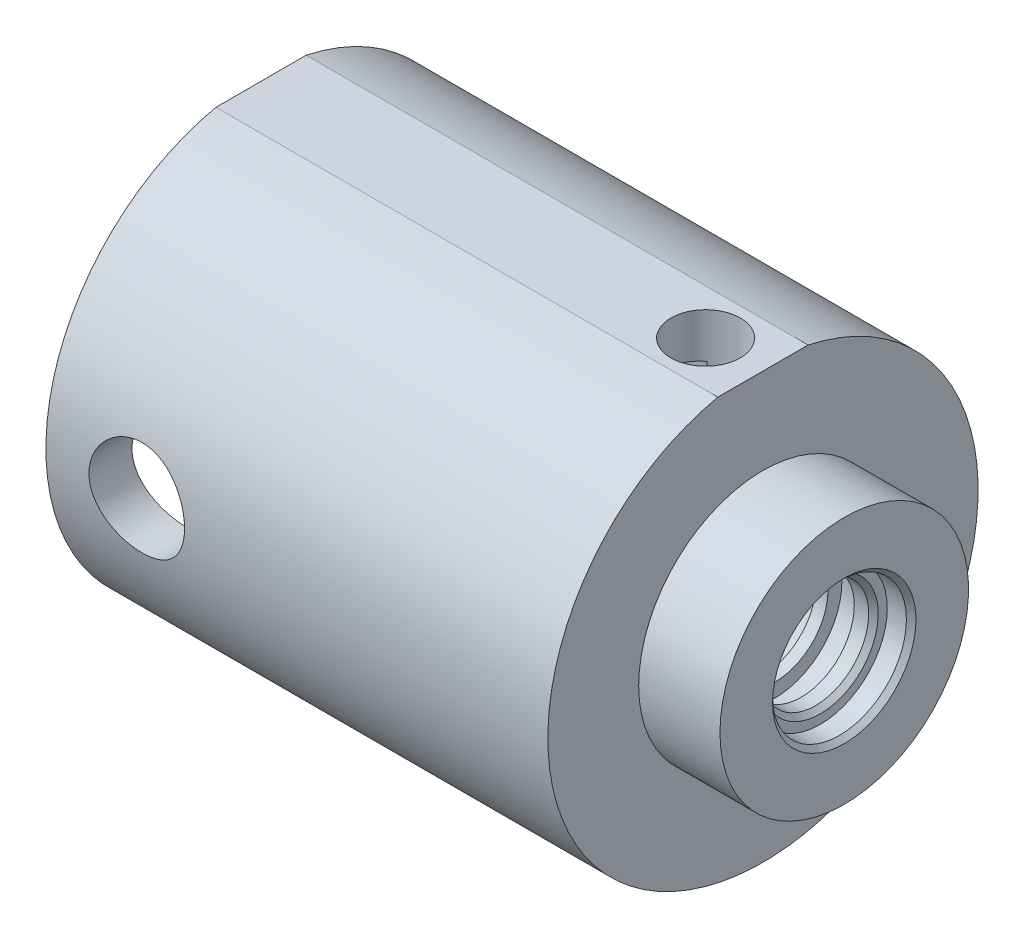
ISO-10303-21;
HEADER;
FILE_DESCRIPTION(('STEP AP214'),'2;1');
FILE_NAME('part.step','',(''),(''),'','','');
FILE_SCHEMA(('AUTOMOTIVE_DESIGN { 1 0 10303 214 1 1 1 1 }'));
ENDSEC;
DATA;
#1=APPLICATION_CONTEXT('core data for automotive mechanical design processes');
#2=APPLICATION_PROTOCOL_DEFINITION('international standard','automotive_design',2000,#1);
#3=PRODUCT_CONTEXT('',#1,'mechanical');
#4=PRODUCT('Part','Part','',(#3));
#5=PRODUCT_RELATED_PRODUCT_CATEGORY('part','',(#4));
#6=PRODUCT_DEFINITION_FORMATION('','',#4);
#7=PRODUCT_DEFINITION_CONTEXT('part definition',#1,'design');
#8=PRODUCT_DEFINITION('design','',#6,#7);
#9=PRODUCT_DEFINITION_SHAPE('','',#8);
#10=(LENGTH_UNIT() NAMED_UNIT(*) SI_UNIT(.MILLI.,.METRE.));
#11=(NAMED_UNIT(*) PLANE_ANGLE_UNIT() SI_UNIT($,.RADIAN.));
#12=(NAMED_UNIT(*) SI_UNIT($,.STERADIAN.) SOLID_ANGLE_UNIT());
#13=UNCERTAINTY_MEASURE_WITH_UNIT(LENGTH_MEASURE(1.E-05),#10,'distance_accuracy_value','');
#14=(GEOMETRIC_REPRESENTATION_CONTEXT(3) GLOBAL_UNCERTAINTY_ASSIGNED_CONTEXT((#13)) GLOBAL_UNIT_ASSIGNED_CONTEXT((#10,
#11,#12)) REPRESENTATION_CONTEXT('',''));
#15=CARTESIAN_POINT('',(0.,0.,0.));
#16=DIRECTION('',(0.,0.,1.));
#17=DIRECTION('',(1.,0.,0.));
#18=AXIS2_PLACEMENT_3D('',#15,#16,#17);
#19=CARTESIAN_POINT('',(0.,0.,0.));
#20=DIRECTION('',(1.,0.,0.));
#21=DIRECTION('',(0.,0.,-1.));
#22=AXIS2_PLACEMENT_3D('',#19,#20,#21);
#23=PLANE('',#22);
#24=CARTESIAN_POINT('',(0.,0.,0.));
#25=DIRECTION('',(1.,0.,0.));
#26=DIRECTION('',(0.,0.,-1.));
#27=AXIS2_PLACEMENT_3D('',#24,#25,#26);
#28=CIRCLE('',#27,36.);
#29=CARTESIAN_POINT('',(0.,0.,-36.));
#30=VERTEX_POINT('',#29);
#31=EDGE_CURVE('E107',#30,#30,#28,.T.);
#32=ORIENTED_EDGE('',*,*,#31,.T.);
#33=EDGE_LOOP('',(#32));
#34=FACE_BOUND('',#33,.T.);
#35=CARTESIAN_POINT('',(0.,0.,0.));
#36=DIRECTION('',(-1.,0.,0.));
#37=DIRECTION('',(0.,0.,1.));
#38=AXIS2_PLACEMENT_3D('',#35,#36,#37);
#39=CIRCLE('',#38,45.);
#40=CARTESIAN_POINT('',(0.,44.,-9.43398113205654));
#41=VERTEX_POINT('',#40);
#42=CARTESIAN_POINT('',(0.,44.,9.43398113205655));
#43=VERTEX_POINT('',#42);
#44=EDGE_CURVE('E111',#41,#43,#39,.T.);
#45=ORIENTED_EDGE('',*,*,#44,.T.);
#46=DIRECTION('',(0.,0.,-1.));
#47=VECTOR('',#46,1.);
#48=CARTESIAN_POINT('',(0.,44.,-72.2300198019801));
#49=LINE('',#48,#47);
#50=EDGE_CURVE('E112',#43,#41,#49,.T.);
#51=ORIENTED_EDGE('',*,*,#50,.T.);
#52=EDGE_LOOP('',(#45,#51));
#53=FACE_BOUND('',#52,.T.);
#54=ADVANCED_FACE('F33',(#34,#53),#23,.F.);
#55=CARTESIAN_POINT('',(0.,0.,0.));
#56=DIRECTION('',(-1.,0.,0.));
#57=DIRECTION('',(0.,0.,1.));
#58=AXIS2_PLACEMENT_3D('',#55,#56,#57);
#59=CYLINDRICAL_SURFACE('',#58,45.);
#60=CARTESIAN_POINT('',(29.,0.,-45.));
#61=CARTESIAN_POINT('',(29.0000065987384,0.277292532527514,-45.0000036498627));
#62=CARTESIAN_POINT('',(28.9884638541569,0.554507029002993,-44.9974327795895));
#63=CARTESIAN_POINT('',(28.9424008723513,1.10700771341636,-44.9872290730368));
#64=CARTESIAN_POINT('',(28.9078772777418,1.38229361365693,-44.9795954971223));
#65=CARTESIAN_POINT('',(28.8160968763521,1.92902691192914,-44.9594680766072));
#66=CARTESIAN_POINT('',(28.7588263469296,2.20047189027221,-44.9469712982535));
#67=CARTESIAN_POINT('',(28.6220141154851,2.73744497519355,-44.9174653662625));
#68=CARTESIAN_POINT('',(28.5424719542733,3.00297295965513,-44.9004561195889));
#69=CARTESIAN_POINT('',(28.3618385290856,3.52596609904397,-44.8624145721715));
#70=CARTESIAN_POINT('',(28.2607709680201,3.78343976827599,-44.8413866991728));
#71=CARTESIAN_POINT('',(28.0377982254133,4.28888117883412,-44.7958691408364));
#72=CARTESIAN_POINT('',(27.9158928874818,4.53684884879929,-44.7713794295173));
#73=CARTESIAN_POINT('',(27.6521621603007,5.02157371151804,-44.7196064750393));
#74=CARTESIAN_POINT('',(27.5103411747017,5.25833336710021,-44.6923238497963));
#75=CARTESIAN_POINT('',(27.2077010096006,5.71923765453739,-44.6356837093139));
#76=CARTESIAN_POINT('',(27.0468750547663,5.94337774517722,-44.6063254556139));
#77=CARTESIAN_POINT('',(26.7049062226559,6.3806395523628,-44.545896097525));
#78=CARTESIAN_POINT('',(26.5235037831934,6.59355573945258,-44.5148063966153));
#79=CARTESIAN_POINT('',(26.1434605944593,7.00350850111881,-44.4521528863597));
#80=CARTESIAN_POINT('',(25.9448120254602,7.20053779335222,-44.4205888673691));
#81=CARTESIAN_POINT('',(25.5316536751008,7.57731293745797,-44.3578720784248));
#82=CARTESIAN_POINT('',(25.3171424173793,7.75705717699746,-44.3267193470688));
#83=CARTESIAN_POINT('',(24.8737971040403,8.09794183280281,-44.2657126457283));
#84=CARTESIAN_POINT('',(24.6449695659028,8.25909062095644,-44.2358580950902));
#85=CARTESIAN_POINT('',(24.1716168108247,8.563556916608,-44.1779334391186));
#86=CARTESIAN_POINT('',(23.9269371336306,8.7066392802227,-44.1498888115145));
#87=CARTESIAN_POINT('',(23.4261544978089,8.97158678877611,-44.0968126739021));
#88=CARTESIAN_POINT('',(23.170055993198,9.09346011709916,-44.0717800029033));
#89=CARTESIAN_POINT('',(22.6481141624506,9.31513068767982,-44.0254605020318));
#90=CARTESIAN_POINT('',(22.3822698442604,9.41492567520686,-44.0041740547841));
#91=CARTESIAN_POINT('',(21.8427715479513,9.59162213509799,-43.9659978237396));
#92=CARTESIAN_POINT('',(21.5691177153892,9.66852403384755,-43.949107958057));
#93=CARTESIAN_POINT('',(21.0204466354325,9.79775244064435,-43.9204776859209));
#94=CARTESIAN_POINT('',(20.7455216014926,9.85045321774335,-43.908659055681));
#95=CARTESIAN_POINT('',(20.1920515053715,9.93263714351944,-43.8901412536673));
#96=CARTESIAN_POINT('',(19.9135064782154,9.96212051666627,-43.8834420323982));
#97=CARTESIAN_POINT('',(19.3548789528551,9.99761892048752,-43.8753683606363));
#98=CARTESIAN_POINT('',(19.0747966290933,10.0036365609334,-43.8739933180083));
#99=CARTESIAN_POINT('',(18.5151410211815,9.99215921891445,-43.8766086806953));
#100=CARTESIAN_POINT('',(18.2355677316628,9.9746644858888,-43.8805990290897));
#101=CARTESIAN_POINT('',(17.684253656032,9.9168634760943,-43.8936974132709));
#102=CARTESIAN_POINT('',(17.4124646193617,9.87699387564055,-43.9027074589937));
#103=CARTESIAN_POINT('',(16.8732837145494,9.77508831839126,-43.9255093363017));
#104=CARTESIAN_POINT('',(16.6058917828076,9.71305268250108,-43.9393010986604));
#105=CARTESIAN_POINT('',(16.0773921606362,9.56731376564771,-43.9712640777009));
#106=CARTESIAN_POINT('',(15.816283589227,9.48361354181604,-43.9894346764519));
#107=CARTESIAN_POINT('',(15.301984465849,9.29514481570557,-44.0296441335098));
#108=CARTESIAN_POINT('',(15.0487969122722,9.19036844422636,-44.0516844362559));
#109=CARTESIAN_POINT('',(14.5501360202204,8.95961990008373,-44.0991971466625));
#110=CARTESIAN_POINT('',(14.304740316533,8.83348533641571,-44.1246955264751));
#111=CARTESIAN_POINT('',(13.8254077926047,8.56151462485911,-44.1782714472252));
#112=CARTESIAN_POINT('',(13.5914714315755,8.41567768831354,-44.2063490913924));
#113=CARTESIAN_POINT('',(13.1365588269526,8.10529982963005,-44.2643087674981));
#114=CARTESIAN_POINT('',(12.915583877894,7.94075704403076,-44.2941909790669));
#115=CARTESIAN_POINT('',(12.4880359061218,7.59408139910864,-44.3549420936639));
#116=CARTESIAN_POINT('',(12.2814630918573,7.4119482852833,-44.3858110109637));
#117=CARTESIAN_POINT('',(11.8795970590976,7.02701918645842,-44.4483954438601));
#118=CARTESIAN_POINT('',(11.6846597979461,6.82385195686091,-44.4801144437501));
#119=CARTESIAN_POINT('',(11.3125580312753,6.40174924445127,-44.5428234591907));
#120=CARTESIAN_POINT('',(11.1353932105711,6.18281404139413,-44.5738134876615));
#121=CARTESIAN_POINT('',(10.8000216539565,5.73058616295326,-44.6342068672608));
#122=CARTESIAN_POINT('',(10.6418193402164,5.4972901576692,-44.6636098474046));
#123=CARTESIAN_POINT('',(10.3456109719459,5.01805446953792,-44.7199877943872));
#124=CARTESIAN_POINT('',(10.2075971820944,4.7721196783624,-44.7469636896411));
#125=CARTESIAN_POINT('',(9.95240169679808,4.26858607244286,-44.7978052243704));
#126=CARTESIAN_POINT('',(9.83527227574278,4.01095995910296,-44.8216630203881));
#127=CARTESIAN_POINT('',(9.62317143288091,3.48641893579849,-44.8655117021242));
#128=CARTESIAN_POINT('',(9.52820010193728,3.21950398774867,-44.8855025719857));
#129=CARTESIAN_POINT('',(9.36118873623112,2.67833807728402,-44.9210420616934));
#130=CARTESIAN_POINT('',(9.28914589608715,2.40408801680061,-44.9365912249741));
#131=CARTESIAN_POINT('',(9.16857406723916,1.85023813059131,-44.9628009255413));
#132=CARTESIAN_POINT('',(9.12004462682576,1.57063840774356,-44.9734615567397));
#133=CARTESIAN_POINT('',(9.0476592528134,1.01394361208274,-44.9894195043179));
#134=CARTESIAN_POINT('',(9.02331830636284,0.736914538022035,-44.994822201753));
#135=CARTESIAN_POINT('',(8.99779101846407,0.181740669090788,-45.0004891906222));
#136=CARTESIAN_POINT('',(8.99660436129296,-0.0964041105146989,-45.0007535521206));
#137=CARTESIAN_POINT('',(9.01739443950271,-0.651764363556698,-44.9961366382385));
#138=CARTESIAN_POINT('',(9.03936966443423,-0.928979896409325,-44.991255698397));
#139=CARTESIAN_POINT('',(9.10629903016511,-1.48048652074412,-44.9764855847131));
#140=CARTESIAN_POINT('',(9.15125310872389,-1.75477762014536,-44.9665964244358));
#141=CARTESIAN_POINT('',(9.26313086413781,-2.29536494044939,-44.9422260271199));
#142=CARTESIAN_POINT('',(9.32979850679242,-2.56171663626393,-44.9277983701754));
#143=CARTESIAN_POINT('',(9.48471147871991,-3.08779421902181,-44.8947100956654));
#144=CARTESIAN_POINT('',(9.5729565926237,-3.34752017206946,-44.8760495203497));
#145=CARTESIAN_POINT('',(9.77034528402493,-3.85856164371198,-44.8349998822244));
#146=CARTESIAN_POINT('',(9.8794863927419,-4.10987815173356,-44.8126112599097));
#147=CARTESIAN_POINT('',(10.1179209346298,-4.60256450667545,-44.7646924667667));
#148=CARTESIAN_POINT('',(10.2472220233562,-4.84393053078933,-44.7391611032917));
#149=CARTESIAN_POINT('',(10.5270161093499,-5.31840892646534,-44.6852587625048));
#150=CARTESIAN_POINT('',(10.6777847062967,-5.55135478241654,-44.6568525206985));
#151=CARTESIAN_POINT('',(10.9981020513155,-6.00387463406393,-44.5982687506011));
#152=CARTESIAN_POINT('',(11.1676592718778,-6.22344252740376,-44.568090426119));
#153=CARTESIAN_POINT('',(11.524369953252,-6.64768915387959,-44.5067880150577));
#154=CARTESIAN_POINT('',(11.7115255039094,-6.85236611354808,-44.4756638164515));
#155=CARTESIAN_POINT('',(12.1020889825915,-7.24538073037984,-44.413331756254));
#156=CARTESIAN_POINT('',(12.3054897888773,-7.43372547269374,-44.3821239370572));
#157=CARTESIAN_POINT('',(12.7314098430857,-7.79644386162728,-44.3198600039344));
#158=CARTESIAN_POINT('',(12.9542247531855,-7.97047308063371,-44.2888187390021));
#159=CARTESIAN_POINT('',(13.4138526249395,-8.29908057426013,-44.2284203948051));
#160=CARTESIAN_POINT('',(13.6506603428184,-8.45366606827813,-44.1990626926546));
#161=CARTESIAN_POINT('',(14.136782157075,-8.74237037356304,-44.1428658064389));
#162=CARTESIAN_POINT('',(14.3860983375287,-8.87648575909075,-44.1160270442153));
#163=CARTESIAN_POINT('',(14.8954768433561,-9.12321059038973,-44.0656656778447));
#164=CARTESIAN_POINT('',(15.1555390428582,-9.23582028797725,-44.042143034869));
#165=CARTESIAN_POINT('',(15.6830528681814,-9.43807156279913,-43.9992436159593));
#166=CARTESIAN_POINT('',(15.9504533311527,-9.52784164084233,-43.9798437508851));
#167=CARTESIAN_POINT('',(16.4921557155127,-9.68453472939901,-43.9456053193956));
#168=CARTESIAN_POINT('',(16.7664576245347,-9.75145778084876,-43.9307667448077));
#169=CARTESIAN_POINT('',(17.3199187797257,-9.86189354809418,-43.9061073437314));
#170=CARTESIAN_POINT('',(17.5990773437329,-9.90540952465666,-43.8962858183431));
#171=CARTESIAN_POINT('',(18.1602087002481,-9.96867412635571,-43.8819620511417));
#172=CARTESIAN_POINT('',(18.4421814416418,-9.98842318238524,-43.877459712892));
#173=CARTESIAN_POINT('',(19.0004452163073,-10.0038096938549,-43.8739540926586));
#174=CARTESIAN_POINT('',(19.2767209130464,-9.99998107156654,-43.8748290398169));
#175=CARTESIAN_POINT('',(19.8279402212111,-9.96948872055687,-43.8817677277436));
#176=CARTESIAN_POINT('',(20.1028838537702,-9.94282535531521,-43.8878313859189));
#177=CARTESIAN_POINT('',(20.6494639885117,-9.86688391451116,-43.9049668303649));
#178=CARTESIAN_POINT('',(20.9211005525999,-9.8176062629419,-43.9160385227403));
#179=CARTESIAN_POINT('',(21.4591518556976,-9.69683425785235,-43.9428631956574));
#180=CARTESIAN_POINT('',(21.7255665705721,-9.62533980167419,-43.9586161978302));
#181=CARTESIAN_POINT('',(22.2502939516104,-9.46101899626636,-43.9942740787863));
#182=CARTESIAN_POINT('',(22.5086342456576,-9.36827722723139,-44.0141624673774));
#183=CARTESIAN_POINT('',(23.0166522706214,-9.1619700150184,-44.0575693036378));
#184=CARTESIAN_POINT('',(23.2663268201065,-9.04839701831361,-44.0810890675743));
#185=CARTESIAN_POINT('',(23.7552439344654,-8.80128816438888,-44.1310911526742));
#186=CARTESIAN_POINT('',(23.9944876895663,-8.66775459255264,-44.1575731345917));
#187=CARTESIAN_POINT('',(24.4610398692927,-8.38164256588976,-44.2127728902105));
#188=CARTESIAN_POINT('',(24.6883477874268,-8.22906330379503,-44.2414907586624));
#189=CARTESIAN_POINT('',(25.1341743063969,-7.90252073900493,-44.3009962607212));
#190=CARTESIAN_POINT('',(25.3524110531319,-7.72817808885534,-44.3318145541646));
#191=CARTESIAN_POINT('',(25.7734919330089,-7.36190709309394,-44.3941079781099));
#192=CARTESIAN_POINT('',(25.9763358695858,-7.16997852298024,-44.4255831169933));
#193=CARTESIAN_POINT('',(26.3653318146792,-6.76976925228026,-44.4883271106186));
#194=CARTESIAN_POINT('',(26.5514798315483,-6.56148466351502,-44.5195959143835));
#195=CARTESIAN_POINT('',(26.9057699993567,-6.12998600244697,-44.5810582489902));
#196=CARTESIAN_POINT('',(27.0739125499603,-5.90677226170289,-44.6112518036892));
#197=CARTESIAN_POINT('',(27.3932127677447,-5.44372545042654,-44.6701360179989));
#198=CARTESIAN_POINT('',(27.5441056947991,-5.2037063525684,-44.6988003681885));
#199=CARTESIAN_POINT('',(27.8250379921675,-4.71157718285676,-44.7533497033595));
#200=CARTESIAN_POINT('',(27.9550850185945,-4.45947159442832,-44.7792357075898));
#201=CARTESIAN_POINT('',(28.1933410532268,-3.94496956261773,-44.8274904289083));
#202=CARTESIAN_POINT('',(28.3015617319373,-3.68257870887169,-44.849861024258));
#203=CARTESIAN_POINT('',(28.495373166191,-3.1493491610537,-44.8904574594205));
#204=CARTESIAN_POINT('',(28.5809678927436,-2.87851195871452,-44.90868402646));
#205=CARTESIAN_POINT('',(28.7691264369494,-2.18089534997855,-44.9491170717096));
#206=CARTESIAN_POINT('',(28.8555730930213,-1.74946626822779,-44.968091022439));
#207=CARTESIAN_POINT('',(28.9710032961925,-0.878625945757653,-44.9935293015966));
#208=CARTESIAN_POINT('',(28.999989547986,-0.439215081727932,-44.9999942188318));
#209=CARTESIAN_POINT('',(29.,0.,-45.));
#210=B_SPLINE_CURVE_WITH_KNOTS('',3,(#60,#61,#62,#63,#64,#65,#66,#67,#68,#69,#70,#71,#72,#73,
#74,#75,#76,#77,#78,#79,#80,#81,#82,#83,#84,#85,#86,#87,#88,#89,#90,#91,#92,#93,#94,#95,#96,#97,
#98,#99,#100,#101,#102,#103,#104,#105,#106,#107,#108,#109,#110,#111,#112,#113,#114,#115,#116,
#117,#118,#119,#120,#121,#122,#123,#124,#125,#126,#127,#128,#129,#130,#131,#132,#133,#134,#135,
#136,#137,#138,#139,#140,#141,#142,#143,#144,#145,#146,#147,#148,#149,#150,#151,#152,#153,#154,
#155,#156,#157,#158,#159,#160,#161,#162,#163,#164,#165,#166,#167,#168,#169,#170,#171,#172,#173,
#174,#175,#176,#177,#178,#179,#180,#181,#182,#183,#184,#185,#186,#187,#188,#189,#190,#191,#192,
#193,#194,#195,#196,#197,#198,#199,#200,#201,#202,#203,#204,#205,#206,#207,#208,#209),
.UNSPECIFIED.,.T.,.F.,(4,2,2,2,2,2,2,2,2,2,2,2,2,2,2,2,2,2,2,2,2,2,2,2,2,2,2,2,2,2,2,2,2,2,2,2,
2,2,2,2,2,2,2,2,2,2,2,2,2,2,2,2,2,2,2,2,2,2,2,2,2,2,2,2,2,2,2,2,2,2,2,2,2,2,4),(0.,
0.831491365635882,1.66310423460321,2.49521955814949,3.32735203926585,4.15857290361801,
4.98980000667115,5.82084360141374,6.65218436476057,7.49551485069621,8.33922973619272,
9.18302324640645,10.0264353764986,10.8798892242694,11.733013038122,12.5862239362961,
13.4394189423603,14.2789339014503,15.1184407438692,15.9578542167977,16.7972587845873,
17.6208240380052,18.4443773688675,19.267814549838,20.0915597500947,20.921875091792,
21.7522236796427,22.5826550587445,23.4130984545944,24.2621293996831,25.111145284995,
25.9603587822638,26.8092460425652,27.6602291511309,28.5112157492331,29.3620981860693,
30.2129642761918,31.0464025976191,31.8798295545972,32.7132021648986,33.5465725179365,
34.3704519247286,35.1943231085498,36.0180970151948,36.8421845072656,37.6780091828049,
38.5142123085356,39.3505148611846,40.1864527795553,41.0387061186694,41.8906420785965,
42.742720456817,43.5947888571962,44.4419516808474,45.2891129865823,46.1361562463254,
46.983184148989,47.8111025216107,48.6390077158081,49.4668973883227,50.2947908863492,
51.1194443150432,51.944397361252,52.7692560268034,53.594149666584,54.4362324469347,
55.2783259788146,56.1206203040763,56.9628959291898,57.8167297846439,58.6702493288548,
59.5233112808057,60.3762234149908,61.6933188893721,63.0103523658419),.UNSPECIFIED.);
#211=CARTESIAN_POINT('',(29.,0.,-45.));
#212=VERTEX_POINT('',#211);
#213=EDGE_CURVE('E292',#212,#212,#210,.T.);
#214=ORIENTED_EDGE('',*,*,#213,.T.);
#215=EDGE_LOOP('',(#214));
#216=FACE_BOUND('',#215,.T.);
#217=CARTESIAN_POINT('',(29.,0.,45.));
#218=CARTESIAN_POINT('',(29.0000065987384,-0.277292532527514,45.0000036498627));
#219=CARTESIAN_POINT('',(28.9884638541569,-0.554507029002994,44.9974327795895));
#220=CARTESIAN_POINT('',(28.9424008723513,-1.10700771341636,44.9872290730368));
#221=CARTESIAN_POINT('',(28.9078772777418,-1.38229361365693,44.9795954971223));
#222=CARTESIAN_POINT('',(28.8160968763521,-1.92902691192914,44.9594680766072));
#223=CARTESIAN_POINT('',(28.7588263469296,-2.20047189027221,44.9469712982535));
#224=CARTESIAN_POINT('',(28.6220141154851,-2.73744497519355,44.9174653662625));
#225=CARTESIAN_POINT('',(28.5424719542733,-3.00297295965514,44.9004561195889));
#226=CARTESIAN_POINT('',(28.3618385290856,-3.52596609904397,44.8624145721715));
#227=CARTESIAN_POINT('',(28.2607709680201,-3.783439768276,44.8413866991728));
#228=CARTESIAN_POINT('',(28.0377982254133,-4.28888117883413,44.7958691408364));
#229=CARTESIAN_POINT('',(27.9158928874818,-4.5368488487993,44.7713794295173));
#230=CARTESIAN_POINT('',(27.6521621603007,-5.02157371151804,44.7196064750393));
#231=CARTESIAN_POINT('',(27.5103411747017,-5.25833336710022,44.6923238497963));
#232=CARTESIAN_POINT('',(27.2077010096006,-5.71923765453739,44.6356837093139));
#233=CARTESIAN_POINT('',(27.0468750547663,-5.94337774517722,44.6063254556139));
#234=CARTESIAN_POINT('',(26.7049062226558,-6.3806395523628,44.5458960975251));
#235=CARTESIAN_POINT('',(26.5235037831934,-6.59355573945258,44.5148063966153));
#236=CARTESIAN_POINT('',(26.1434605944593,-7.00350850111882,44.4521528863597));
#237=CARTESIAN_POINT('',(25.9448120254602,-7.20053779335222,44.4205888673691));
#238=CARTESIAN_POINT('',(25.5316536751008,-7.57731293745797,44.3578720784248));
#239=CARTESIAN_POINT('',(25.3171424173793,-7.75705717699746,44.3267193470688));
#240=CARTESIAN_POINT('',(24.8737971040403,-8.09794183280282,44.2657126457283));
#241=CARTESIAN_POINT('',(24.6449695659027,-8.25909062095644,44.2358580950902));
#242=CARTESIAN_POINT('',(24.1716168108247,-8.563556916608,44.1779334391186));
#243=CARTESIAN_POINT('',(23.9269371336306,-8.7066392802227,44.1498888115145));
#244=CARTESIAN_POINT('',(23.4261544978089,-8.97158678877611,44.0968126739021));
#245=CARTESIAN_POINT('',(23.170055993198,-9.09346011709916,44.0717800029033));
#246=CARTESIAN_POINT('',(22.6481141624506,-9.31513068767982,44.0254605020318));
#247=CARTESIAN_POINT('',(22.3822698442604,-9.41492567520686,44.0041740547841));
#248=CARTESIAN_POINT('',(21.8427715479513,-9.59162213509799,43.9659978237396));
#249=CARTESIAN_POINT('',(21.5691177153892,-9.66852403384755,43.949107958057));
#250=CARTESIAN_POINT('',(21.0204466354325,-9.79775244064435,43.9204776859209));
#251=CARTESIAN_POINT('',(20.7455216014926,-9.85045321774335,43.908659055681));
#252=CARTESIAN_POINT('',(20.1920515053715,-9.93263714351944,43.8901412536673));
#253=CARTESIAN_POINT('',(19.9135064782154,-9.96212051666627,43.8834420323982));
#254=CARTESIAN_POINT('',(19.3548789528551,-9.99761892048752,43.8753683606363));
#255=CARTESIAN_POINT('',(19.0747966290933,-10.0036365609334,43.8739933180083));
#256=CARTESIAN_POINT('',(18.5151410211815,-9.99215921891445,43.8766086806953));
#257=CARTESIAN_POINT('',(18.2355677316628,-9.9746644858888,43.8805990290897));
#258=CARTESIAN_POINT('',(17.684253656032,-9.9168634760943,43.8936974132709));
#259=CARTESIAN_POINT('',(17.4124646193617,-9.87699387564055,43.9027074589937));
#260=CARTESIAN_POINT('',(16.8732837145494,-9.77508831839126,43.9255093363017));
#261=CARTESIAN_POINT('',(16.6058917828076,-9.71305268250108,43.9393010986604));
#262=CARTESIAN_POINT('',(16.0773921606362,-9.56731376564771,43.9712640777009));
#263=CARTESIAN_POINT('',(15.816283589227,-9.48361354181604,43.9894346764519));
#264=CARTESIAN_POINT('',(15.301984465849,-9.29514481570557,44.0296441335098));
#265=CARTESIAN_POINT('',(15.0487969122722,-9.19036844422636,44.0516844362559));
#266=CARTESIAN_POINT('',(14.5501360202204,-8.95961990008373,44.0991971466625));
#267=CARTESIAN_POINT('',(14.304740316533,-8.83348533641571,44.1246955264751));
#268=CARTESIAN_POINT('',(13.8254077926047,-8.56151462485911,44.1782714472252));
#269=CARTESIAN_POINT('',(13.5914714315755,-8.41567768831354,44.2063490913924));
#270=CARTESIAN_POINT('',(13.1365588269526,-8.10529982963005,44.2643087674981));
#271=CARTESIAN_POINT('',(12.915583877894,-7.94075704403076,44.2941909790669));
#272=CARTESIAN_POINT('',(12.4880359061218,-7.59408139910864,44.3549420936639));
#273=CARTESIAN_POINT('',(12.2814630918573,-7.4119482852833,44.3858110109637));
#274=CARTESIAN_POINT('',(11.8795970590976,-7.02701918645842,44.4483954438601));
#275=CARTESIAN_POINT('',(11.6846597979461,-6.82385195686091,44.4801144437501));
#276=CARTESIAN_POINT('',(11.3125580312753,-6.40174924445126,44.5428234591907));
#277=CARTESIAN_POINT('',(11.1353932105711,-6.18281404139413,44.5738134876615));
#278=CARTESIAN_POINT('',(10.8000216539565,-5.73058616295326,44.6342068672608));
#279=CARTESIAN_POINT('',(10.6418193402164,-5.4972901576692,44.6636098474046));
#280=CARTESIAN_POINT('',(10.3456109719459,-5.01805446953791,44.7199877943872));
#281=CARTESIAN_POINT('',(10.2075971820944,-4.7721196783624,44.7469636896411));
#282=CARTESIAN_POINT('',(9.95240169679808,-4.26858607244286,44.7978052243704));
#283=CARTESIAN_POINT('',(9.83527227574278,-4.01095995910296,44.8216630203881));
#284=CARTESIAN_POINT('',(9.62317143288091,-3.48641893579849,44.8655117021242));
#285=CARTESIAN_POINT('',(9.52820010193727,-3.21950398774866,44.8855025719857));
#286=CARTESIAN_POINT('',(9.36118873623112,-2.67833807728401,44.9210420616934));
#287=CARTESIAN_POINT('',(9.28914589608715,-2.40408801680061,44.9365912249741));
#288=CARTESIAN_POINT('',(9.16857406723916,-1.85023813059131,44.9628009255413));
#289=CARTESIAN_POINT('',(9.12004462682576,-1.57063840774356,44.9734615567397));
#290=CARTESIAN_POINT('',(9.0476592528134,-1.01394361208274,44.9894195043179));
#291=CARTESIAN_POINT('',(9.02331830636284,-0.736914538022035,44.994822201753));
#292=CARTESIAN_POINT('',(8.99779101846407,-0.181740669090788,45.0004891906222));
#293=CARTESIAN_POINT('',(8.99660436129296,0.096404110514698,45.0007535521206));
#294=CARTESIAN_POINT('',(9.01739443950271,0.651764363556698,44.9961366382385));
#295=CARTESIAN_POINT('',(9.03936966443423,0.928979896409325,44.991255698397));
#296=CARTESIAN_POINT('',(9.10629903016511,1.48048652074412,44.9764855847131));
#297=CARTESIAN_POINT('',(9.15125310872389,1.75477762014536,44.9665964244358));
#298=CARTESIAN_POINT('',(9.26313086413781,2.29536494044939,44.9422260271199));
#299=CARTESIAN_POINT('',(9.32979850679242,2.56171663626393,44.9277983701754));
#300=CARTESIAN_POINT('',(9.48471147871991,3.08779421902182,44.8947100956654));
#301=CARTESIAN_POINT('',(9.5729565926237,3.34752017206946,44.8760495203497));
#302=CARTESIAN_POINT('',(9.77034528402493,3.85856164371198,44.8349998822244));
#303=CARTESIAN_POINT('',(9.8794863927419,4.10987815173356,44.8126112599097));
#304=CARTESIAN_POINT('',(10.1179209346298,4.60256450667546,44.7646924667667));
#305=CARTESIAN_POINT('',(10.2472220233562,4.84393053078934,44.7391611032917));
#306=CARTESIAN_POINT('',(10.5270161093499,5.31840892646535,44.6852587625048));
#307=CARTESIAN_POINT('',(10.6777847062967,5.55135478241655,44.6568525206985));
#308=CARTESIAN_POINT('',(10.9981020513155,6.00387463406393,44.5982687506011));
#309=CARTESIAN_POINT('',(11.1676592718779,6.22344252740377,44.568090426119));
#310=CARTESIAN_POINT('',(11.524369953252,6.6476891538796,44.5067880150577));
#311=CARTESIAN_POINT('',(11.7115255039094,6.85236611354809,44.4756638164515));
#312=CARTESIAN_POINT('',(12.1020889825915,7.24538073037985,44.413331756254));
#313=CARTESIAN_POINT('',(12.3054897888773,7.43372547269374,44.3821239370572));
#314=CARTESIAN_POINT('',(12.7314098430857,7.79644386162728,44.3198600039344));
#315=CARTESIAN_POINT('',(12.9542247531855,7.97047308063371,44.2888187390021));
#316=CARTESIAN_POINT('',(13.4138526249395,8.29908057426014,44.2284203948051));
#317=CARTESIAN_POINT('',(13.6506603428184,8.45366606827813,44.1990626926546));
#318=CARTESIAN_POINT('',(14.136782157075,8.74237037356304,44.1428658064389));
#319=CARTESIAN_POINT('',(14.3860983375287,8.87648575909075,44.1160270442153));
#320=CARTESIAN_POINT('',(14.8954768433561,9.12321059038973,44.0656656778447));
#321=CARTESIAN_POINT('',(15.1555390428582,9.23582028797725,44.042143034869));
#322=CARTESIAN_POINT('',(15.6830528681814,9.43807156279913,43.9992436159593));
#323=CARTESIAN_POINT('',(15.9504533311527,9.52784164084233,43.9798437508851));
#324=CARTESIAN_POINT('',(16.4921557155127,9.68453472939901,43.9456053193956));
#325=CARTESIAN_POINT('',(16.7664576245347,9.75145778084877,43.9307667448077));
#326=CARTESIAN_POINT('',(17.3199187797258,9.86189354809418,43.9061073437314));
#327=CARTESIAN_POINT('',(17.5990773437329,9.90540952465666,43.8962858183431));
#328=CARTESIAN_POINT('',(18.1602087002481,9.96867412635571,43.8819620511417));
#329=CARTESIAN_POINT('',(18.4421814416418,9.98842318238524,43.877459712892));
#330=CARTESIAN_POINT('',(19.0004452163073,10.0038096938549,43.8739540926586));
#331=CARTESIAN_POINT('',(19.2767209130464,9.99998107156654,43.8748290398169));
#332=CARTESIAN_POINT('',(19.8279402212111,9.96948872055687,43.8817677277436));
#333=CARTESIAN_POINT('',(20.1028838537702,9.94282535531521,43.8878313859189));
#334=CARTESIAN_POINT('',(20.6494639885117,9.86688391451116,43.9049668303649));
#335=CARTESIAN_POINT('',(20.9211005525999,9.8176062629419,43.9160385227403));
#336=CARTESIAN_POINT('',(21.4591518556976,9.69683425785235,43.9428631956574));
#337=CARTESIAN_POINT('',(21.7255665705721,9.62533980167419,43.9586161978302));
#338=CARTESIAN_POINT('',(22.2502939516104,9.46101899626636,43.9942740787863));
#339=CARTESIAN_POINT('',(22.5086342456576,9.36827722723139,44.0141624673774));
#340=CARTESIAN_POINT('',(23.0166522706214,9.1619700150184,44.0575693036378));
#341=CARTESIAN_POINT('',(23.2663268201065,9.04839701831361,44.0810890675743));
#342=CARTESIAN_POINT('',(23.7552439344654,8.80128816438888,44.1310911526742));
#343=CARTESIAN_POINT('',(23.9944876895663,8.66775459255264,44.1575731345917));
#344=CARTESIAN_POINT('',(24.4610398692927,8.38164256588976,44.2127728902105));
#345=CARTESIAN_POINT('',(24.6883477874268,8.22906330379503,44.2414907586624));
#346=CARTESIAN_POINT('',(25.1341743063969,7.90252073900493,44.3009962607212));
#347=CARTESIAN_POINT('',(25.3524110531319,7.72817808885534,44.3318145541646));
#348=CARTESIAN_POINT('',(25.7734919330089,7.36190709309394,44.3941079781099));
#349=CARTESIAN_POINT('',(25.9763358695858,7.16997852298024,44.4255831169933));
#350=CARTESIAN_POINT('',(26.3653318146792,6.76976925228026,44.4883271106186));
#351=CARTESIAN_POINT('',(26.5514798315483,6.56148466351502,44.5195959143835));
#352=CARTESIAN_POINT('',(26.9057699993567,6.12998600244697,44.5810582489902));
#353=CARTESIAN_POINT('',(27.0739125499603,5.90677226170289,44.6112518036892));
#354=CARTESIAN_POINT('',(27.3932127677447,5.44372545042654,44.6701360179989));
#355=CARTESIAN_POINT('',(27.5441056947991,5.2037063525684,44.6988003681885));
#356=CARTESIAN_POINT('',(27.8250379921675,4.71157718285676,44.7533497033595));
#357=CARTESIAN_POINT('',(27.9550850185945,4.45947159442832,44.7792357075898));
#358=CARTESIAN_POINT('',(28.1933410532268,3.94496956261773,44.8274904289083));
#359=CARTESIAN_POINT('',(28.3015617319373,3.68257870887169,44.849861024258));
#360=CARTESIAN_POINT('',(28.495373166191,3.1493491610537,44.8904574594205));
#361=CARTESIAN_POINT('',(28.5809678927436,2.87851195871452,44.9086840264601));
#362=CARTESIAN_POINT('',(28.7691264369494,2.18089534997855,44.9491170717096));
#363=CARTESIAN_POINT('',(28.8555730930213,1.74946626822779,44.968091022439));
#364=CARTESIAN_POINT('',(28.9710032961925,0.878625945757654,44.9935293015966));
#365=CARTESIAN_POINT('',(28.999989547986,0.439215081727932,44.9999942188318));
#366=CARTESIAN_POINT('',(29.,0.,45.));
#367=B_SPLINE_CURVE_WITH_KNOTS('',3,(#217,#218,#219,#220,#221,#222,#223,#224,#225,#226,#227,
#228,#229,#230,#231,#232,#233,#234,#235,#236,#237,#238,#239,#240,#241,#242,#243,#244,#245,#246,
#247,#248,#249,#250,#251,#252,#253,#254,#255,#256,#257,#258,#259,#260,#261,#262,#263,#264,#265,
#266,#267,#268,#269,#270,#271,#272,#273,#274,#275,#276,#277,#278,#279,#280,#281,#282,#283,#284,
#285,#286,#287,#288,#289,#290,#291,#292,#293,#294,#295,#296,#297,#298,#299,#300,#301,#302,#303,
#304,#305,#306,#307,#308,#309,#310,#311,#312,#313,#314,#315,#316,#317,#318,#319,#320,#321,#322,
#323,#324,#325,#326,#327,#328,#329,#330,#331,#332,#333,#334,#335,#336,#337,#338,#339,#340,#341,
#342,#343,#344,#345,#346,#347,#348,#349,#350,#351,#352,#353,#354,#355,#356,#357,#358,#359,#360,
#361,#362,#363,#364,#365,#366),.UNSPECIFIED.,.T.,.F.,(4,2,2,2,2,2,2,2,2,2,2,2,2,2,2,2,2,2,2,2,2,
2,2,2,2,2,2,2,2,2,2,2,2,2,2,2,2,2,2,2,2,2,2,2,2,2,2,2,2,2,2,2,2,2,2,2,2,2,2,2,2,2,2,2,2,2,2,2,2,
2,2,2,2,2,4),(0.,0.831491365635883,1.66310423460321,2.49521955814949,3.32735203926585,
4.15857290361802,4.98980000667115,5.82084360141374,6.65218436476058,7.49551485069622,
8.33922973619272,9.18302324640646,10.0264353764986,10.8798892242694,11.733013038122,
12.5862239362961,13.4394189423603,14.2789339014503,15.1184407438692,15.9578542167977,
16.7972587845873,17.6208240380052,18.4443773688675,19.267814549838,20.0915597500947,
20.921875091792,21.7522236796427,22.5826550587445,23.4130984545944,24.2621293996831,
25.1111452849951,25.9603587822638,26.8092460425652,27.6602291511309,28.5112157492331,
29.3620981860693,30.2129642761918,31.0464025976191,31.8798295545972,32.7132021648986,
33.5465725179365,34.3704519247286,35.1943231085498,36.0180970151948,36.8421845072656,
37.6780091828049,38.5142123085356,39.3505148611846,40.1864527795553,41.0387061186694,
41.8906420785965,42.742720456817,43.5947888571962,44.4419516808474,45.2891129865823,
46.1361562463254,46.983184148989,47.8111025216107,48.6390077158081,49.4668973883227,
50.2947908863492,51.1194443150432,51.944397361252,52.7692560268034,53.594149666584,
54.4362324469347,55.2783259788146,56.1206203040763,56.9628959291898,57.816729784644,
58.6702493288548,59.5233112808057,60.3762234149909,61.6933188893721,63.0103523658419),.UNSPECIFIED.);
#368=CARTESIAN_POINT('',(29.,0.,45.));
#369=VERTEX_POINT('',#368);
#370=EDGE_CURVE('E288',#369,#369,#367,.T.);
#371=ORIENTED_EDGE('',*,*,#370,.T.);
#372=EDGE_LOOP('',(#371));
#373=FACE_BOUND('',#372,.T.);
#374=CARTESIAN_POINT('',(105.,0.,0.));
#375=DIRECTION('',(-1.,0.,0.));
#376=DIRECTION('',(0.,0.,1.));
#377=AXIS2_PLACEMENT_3D('',#374,#375,#376);
#378=CIRCLE('',#377,45.);
#379=CARTESIAN_POINT('',(105.,44.,-9.43398113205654));
#380=VERTEX_POINT('',#379);
#381=CARTESIAN_POINT('',(105.,44.,9.43398113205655));
#382=VERTEX_POINT('',#381);
#383=EDGE_CURVE('E116',#380,#382,#378,.T.);
#384=ORIENTED_EDGE('',*,*,#383,.T.);
#385=DIRECTION('',(-1.,0.,0.));
#386=VECTOR('',#385,1.);
#387=CARTESIAN_POINT('',(0.,44.,9.43398113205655));
#388=LINE('',#387,#386);
#389=EDGE_CURVE('E60',#382,#43,#388,.T.);
#390=ORIENTED_EDGE('',*,*,#389,.T.);
#391=ORIENTED_EDGE('',*,*,#44,.F.);
#392=DIRECTION('',(-1.,0.,0.));
#393=VECTOR('',#392,1.);
#394=CARTESIAN_POINT('',(0.,44.,-9.43398113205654));
#395=LINE('',#394,#393);
#396=EDGE_CURVE('E316',#41,#380,#395,.F.);
#397=ORIENTED_EDGE('',*,*,#396,.T.);
#398=EDGE_LOOP('',(#384,#390,#391,#397));
#399=FACE_BOUND('',#398,.T.);
#400=ADVANCED_FACE('F97',(#216,#373,#399),#59,.T.);
#401=CARTESIAN_POINT('',(105.,45.,0.));
#402=DIRECTION('',(-1.,0.,0.));
#403=DIRECTION('',(0.,0.,1.));
#404=AXIS2_PLACEMENT_3D('',#401,#402,#403);
#405=PLANE('',#404);
#406=ORIENTED_EDGE('',*,*,#383,.F.);
#407=DIRECTION('',(0.,0.,1.));
#408=VECTOR('',#407,1.);
#409=CARTESIAN_POINT('',(105.,44.,0.));
#410=LINE('',#409,#408);
#411=EDGE_CURVE('E45',#380,#382,#410,.T.);
#412=ORIENTED_EDGE('',*,*,#411,.T.);
#413=EDGE_LOOP('',(#406,#412));
#414=FACE_BOUND('',#413,.T.);
#415=CARTESIAN_POINT('',(105.,0.,0.));
#416=DIRECTION('',(-1.,0.,0.));
#417=DIRECTION('',(0.,0.,1.));
#418=AXIS2_PLACEMENT_3D('',#415,#416,#417);
#419=CIRCLE('',#418,26.);
#420=CARTESIAN_POINT('',(105.,0.,26.));
#421=VERTEX_POINT('',#420);
#422=EDGE_CURVE('E122',#421,#421,#419,.T.);
#423=ORIENTED_EDGE('',*,*,#422,.T.);
#424=EDGE_LOOP('',(#423));
#425=FACE_BOUND('',#424,.T.);
#426=ADVANCED_FACE('F102',(#414,#425),#405,.F.);
#427=CARTESIAN_POINT('',(0.,0.,0.));
#428=DIRECTION('',(-1.,0.,0.));
#429=DIRECTION('',(0.,0.,1.));
#430=AXIS2_PLACEMENT_3D('',#427,#428,#429);
#431=CYLINDRICAL_SURFACE('',#430,26.);
#432=ORIENTED_EDGE('',*,*,#422,.F.);
#433=EDGE_LOOP('',(#432));
#434=FACE_BOUND('',#433,.T.);
#435=CARTESIAN_POINT('',(122.,0.,0.));
#436=DIRECTION('',(-1.,0.,0.));
#437=DIRECTION('',(0.,0.,1.));
#438=AXIS2_PLACEMENT_3D('',#435,#436,#437);
#439=CIRCLE('',#438,26.);
#440=CARTESIAN_POINT('',(122.,0.,26.));
#441=VERTEX_POINT('',#440);
#442=EDGE_CURVE('E258',#441,#441,#439,.T.);
#443=ORIENTED_EDGE('',*,*,#442,.T.);
#444=EDGE_LOOP('',(#443));
#445=FACE_BOUND('',#444,.T.);
#446=ADVANCED_FACE('F264',(#434,#445),#431,.T.);
#447=CARTESIAN_POINT('',(122.,26.,0.));
#448=DIRECTION('',(-1.,0.,0.));
#449=DIRECTION('',(0.,0.,1.));
#450=AXIS2_PLACEMENT_3D('',#447,#448,#449);
#451=PLANE('',#450);
#452=CARTESIAN_POINT('',(122.,0.,0.));
#453=DIRECTION('',(-1.,0.,0.));
#454=DIRECTION('',(0.,0.,1.));
#455=AXIS2_PLACEMENT_3D('',#452,#453,#454);
#456=CIRCLE('',#455,15.);
#457=CARTESIAN_POINT('',(122.,0.,15.));
#458=VERTEX_POINT('',#457);
#459=EDGE_CURVE('E131',#458,#458,#456,.T.);
#460=ORIENTED_EDGE('',*,*,#459,.T.);
#461=EDGE_LOOP('',(#460));
#462=FACE_BOUND('',#461,.T.);
#463=ORIENTED_EDGE('',*,*,#442,.F.);
#464=EDGE_LOOP('',(#463));
#465=FACE_BOUND('',#464,.T.);
#466=ADVANCED_FACE('F267',(#462,#465),#451,.F.);
#467=CARTESIAN_POINT('',(122.,0.,0.));
#468=DIRECTION('',(1.,0.,0.));
#469=DIRECTION('',(0.,0.,-1.));
#470=AXIS2_PLACEMENT_3D('',#467,#468,#469);
#471=CYLINDRICAL_SURFACE('',#470,36.);
#472=ORIENTED_EDGE('',*,*,#31,.F.);
#473=EDGE_LOOP('',(#472));
#474=FACE_BOUND('',#473,.T.);
#475=CARTESIAN_POINT('',(3.,0.,0.));
#476=DIRECTION('',(1.,0.,0.));
#477=DIRECTION('',(0.,0.,-1.));
#478=AXIS2_PLACEMENT_3D('',#475,#476,#477);
#479=CIRCLE('',#478,36.);
#480=CARTESIAN_POINT('',(3.,0.,-36.));
#481=VERTEX_POINT('',#480);
#482=EDGE_CURVE('E254',#481,#481,#479,.T.);
#483=ORIENTED_EDGE('',*,*,#482,.T.);
#484=EDGE_LOOP('',(#483));
#485=FACE_BOUND('',#484,.T.);
#486=ADVANCED_FACE('F272',(#474,#485),#471,.F.);
#487=CARTESIAN_POINT('',(3.,36.,0.));
#488=DIRECTION('',(-1.,0.,0.));
#489=DIRECTION('',(0.,0.,1.));
#490=AXIS2_PLACEMENT_3D('',#487,#488,#489);
#491=PLANE('',#490);
#492=ORIENTED_EDGE('',*,*,#482,.F.);
#493=EDGE_LOOP('',(#492));
#494=FACE_BOUND('',#493,.T.);
#495=CARTESIAN_POINT('',(3.,0.,0.));
#496=DIRECTION('',(1.,0.,0.));
#497=DIRECTION('',(0.,0.,-1.));
#498=AXIS2_PLACEMENT_3D('',#495,#496,#497);
#499=CIRCLE('',#498,37.5);
#500=CARTESIAN_POINT('',(3.,0.,-37.5));
#501=VERTEX_POINT('',#500);
#502=EDGE_CURVE('E251',#501,#501,#499,.T.);
#503=ORIENTED_EDGE('',*,*,#502,.T.);
#504=EDGE_LOOP('',(#503));
#505=FACE_BOUND('',#504,.T.);
#506=ADVANCED_FACE('F278',(#494,#505),#491,.F.);
#507=CARTESIAN_POINT('',(122.,0.,0.));
#508=DIRECTION('',(1.,0.,0.));
#509=DIRECTION('',(0.,0.,-1.));
#510=AXIS2_PLACEMENT_3D('',#507,#508,#509);
#511=CYLINDRICAL_SURFACE('',#510,37.5);
#512=ORIENTED_EDGE('',*,*,#502,.F.);
#513=EDGE_LOOP('',(#512));
#514=FACE_BOUND('',#513,.T.);
#515=CARTESIAN_POINT('',(7.00000000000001,0.,0.));
#516=DIRECTION('',(1.,0.,0.));
#517=DIRECTION('',(0.,0.,-1.));
#518=AXIS2_PLACEMENT_3D('',#515,#516,#517);
#519=CIRCLE('',#518,37.5);
#520=CARTESIAN_POINT('',(7.00000000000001,0.,-37.5));
#521=VERTEX_POINT('',#520);
#522=EDGE_CURVE('E248',#521,#521,#519,.T.);
#523=ORIENTED_EDGE('',*,*,#522,.T.);
#524=EDGE_LOOP('',(#523));
#525=FACE_BOUND('',#524,.T.);
#526=ADVANCED_FACE('F504',(#514,#525),#511,.F.);
#527=CARTESIAN_POINT('',(7.,37.5,0.));
#528=DIRECTION('',(1.,0.,0.));
#529=DIRECTION('',(0.,0.,-1.));
#530=AXIS2_PLACEMENT_3D('',#527,#528,#529);
#531=PLANE('',#530);
#532=ORIENTED_EDGE('',*,*,#522,.F.);
#533=EDGE_LOOP('',(#532));
#534=FACE_BOUND('',#533,.T.);
#535=CARTESIAN_POINT('',(7.00000000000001,0.,0.));
#536=DIRECTION('',(1.,0.,0.));
#537=DIRECTION('',(0.,0.,-1.));
#538=AXIS2_PLACEMENT_3D('',#535,#536,#537);
#539=CIRCLE('',#538,36.);
#540=CARTESIAN_POINT('',(7.00000000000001,0.,-36.));
#541=VERTEX_POINT('',#540);
#542=EDGE_CURVE('E245',#541,#541,#539,.T.);
#543=ORIENTED_EDGE('',*,*,#542,.T.);
#544=EDGE_LOOP('',(#543));
#545=FACE_BOUND('',#544,.T.);
#546=ADVANCED_FACE('F368',(#534,#545),#531,.F.);
#547=CARTESIAN_POINT('',(122.,0.,0.));
#548=DIRECTION('',(1.,0.,0.));
#549=DIRECTION('',(0.,0.,-1.));
#550=AXIS2_PLACEMENT_3D('',#547,#548,#549);
#551=CYLINDRICAL_SURFACE('',#550,36.);
#552=CARTESIAN_POINT('',(8.99999999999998,0.,-36.));
#553=CARTESIAN_POINT('',(9.00000085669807,0.27522136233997,-35.9999994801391));
#554=CARTESIAN_POINT('',(9.01137149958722,0.550458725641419,-35.9968362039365));
#555=CARTESIAN_POINT('',(9.05675642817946,1.09892773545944,-35.9842691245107));
#556=CARTESIAN_POINT('',(9.09077247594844,1.37215922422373,-35.9748648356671));
#557=CARTESIAN_POINT('',(9.18116568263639,1.91472014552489,-35.9500712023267));
#558=CARTESIAN_POINT('',(9.23755070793,2.18404817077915,-35.9346797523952));
#559=CARTESIAN_POINT('',(9.37220101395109,2.7167958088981,-35.898333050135));
#560=CARTESIAN_POINT('',(9.45046683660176,2.98021527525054,-35.8773776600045));
#561=CARTESIAN_POINT('',(9.62811004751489,3.49896271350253,-35.8305037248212));
#562=CARTESIAN_POINT('',(9.72745786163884,3.75430145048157,-35.8045921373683));
#563=CARTESIAN_POINT('',(9.94655362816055,4.25557652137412,-35.7484780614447));
#564=CARTESIAN_POINT('',(10.0663016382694,4.50151282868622,-35.7182755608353));
#565=CARTESIAN_POINT('',(10.3252954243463,4.9823759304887,-35.6543792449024));
#566=CARTESIAN_POINT('',(10.4645388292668,5.21730405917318,-35.6206858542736));
#567=CARTESIAN_POINT('',(10.7616114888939,5.67480165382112,-35.5506709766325));
#568=CARTESIAN_POINT('',(10.9194474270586,5.8973666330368,-35.5143485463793));
#569=CARTESIAN_POINT('',(11.2562971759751,6.3334541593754,-35.4392070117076));
#570=CARTESIAN_POINT('',(11.4357015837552,6.54666862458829,-35.4003504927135));
#571=CARTESIAN_POINT('',(11.8116810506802,6.95741523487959,-35.3219212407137));
#572=CARTESIAN_POINT('',(12.0082639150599,7.15494017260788,-35.2823481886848));
#573=CARTESIAN_POINT('',(12.4172940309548,7.5329637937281,-35.2035757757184));
#574=CARTESIAN_POINT('',(12.6297435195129,7.71346006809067,-35.1643764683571));
#575=CARTESIAN_POINT('',(13.0690344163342,8.05612888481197,-35.0874567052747));
#576=CARTESIAN_POINT('',(13.295869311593,8.21830962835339,-35.0497355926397));
#577=CARTESIAN_POINT('',(13.7670956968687,8.52628037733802,-34.9761076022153));
#578=CARTESIAN_POINT('',(14.0117418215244,8.6716928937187,-34.9402498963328));
#579=CARTESIAN_POINT('',(14.5128435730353,8.94127159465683,-34.8722381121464));
#580=CARTESIAN_POINT('',(14.7692945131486,9.06544612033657,-34.8400825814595));
#581=CARTESIAN_POINT('',(15.2923366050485,9.29163152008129,-34.7804438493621));
#582=CARTESIAN_POINT('',(15.5589282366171,9.39364134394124,-34.7529608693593));
#583=CARTESIAN_POINT('',(16.100321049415,9.57461847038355,-34.7035371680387));
#584=CARTESIAN_POINT('',(16.3751219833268,9.65358646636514,-34.6815962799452));
#585=CARTESIAN_POINT('',(16.9241148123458,9.78613764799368,-34.6444242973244));
#586=CARTESIAN_POINT('',(17.1981586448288,9.84029205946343,-34.6290428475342));
#587=CARTESIAN_POINT('',(17.7500975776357,9.92550820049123,-34.604714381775));
#588=CARTESIAN_POINT('',(18.0279926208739,9.95657027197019,-34.595767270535));
#589=CARTESIAN_POINT('',(18.5854933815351,9.99531131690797,-34.584594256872));
#590=CARTESIAN_POINT('',(18.8650987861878,10.0029944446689,-34.5823671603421));
#591=CARTESIAN_POINT('',(19.4239395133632,9.99491686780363,-34.5847026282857));
#592=CARTESIAN_POINT('',(19.7031748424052,9.97915658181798,-34.5892650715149));
#593=CARTESIAN_POINT('',(20.2506650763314,9.92517917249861,-34.604791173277));
#594=CARTESIAN_POINT('',(20.5189950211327,9.88766204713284,-34.6155552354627));
#595=CARTESIAN_POINT('',(21.0514279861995,9.79105944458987,-34.643003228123));
#596=CARTESIAN_POINT('',(21.3155311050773,9.73197447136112,-34.6596870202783));
#597=CARTESIAN_POINT('',(21.8376761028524,9.59273653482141,-34.6984815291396));
#598=CARTESIAN_POINT('',(22.0957187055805,9.5125861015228,-34.7205915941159));
#599=CARTESIAN_POINT('',(22.6041659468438,9.33181746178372,-34.7696124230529));
#600=CARTESIAN_POINT('',(22.8545676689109,9.23119154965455,-34.7965249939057));
#601=CARTESIAN_POINT('',(23.3489516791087,9.00893675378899,-34.8547328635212));
#602=CARTESIAN_POINT('',(23.592822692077,8.88707305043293,-34.8860763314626));
#603=CARTESIAN_POINT('',(24.0694820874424,8.62406244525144,-34.9520231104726));
#604=CARTESIAN_POINT('',(24.3022699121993,8.48291457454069,-34.9866265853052));
#605=CARTESIAN_POINT('',(24.7553604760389,8.18228300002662,-35.0581533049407));
#606=CARTESIAN_POINT('',(24.9756612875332,8.02279647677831,-35.0950769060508));
#607=CARTESIAN_POINT('',(25.402412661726,7.68654104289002,-35.170253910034));
#608=CARTESIAN_POINT('',(25.6088629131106,7.5097717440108,-35.2085073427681));
#609=CARTESIAN_POINT('',(26.0137472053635,7.13347197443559,-35.2867085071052));
#610=CARTESIAN_POINT('',(26.2116347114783,6.9333554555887,-35.3266680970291));
#611=CARTESIAN_POINT('',(26.5899098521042,6.51708240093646,-35.4058260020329));
#612=CARTESIAN_POINT('',(26.770297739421,6.30092609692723,-35.4450243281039));
#613=CARTESIAN_POINT('',(27.112399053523,5.85390597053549,-35.5215879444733));
#614=CARTESIAN_POINT('',(27.2741074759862,5.62303823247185,-35.5589527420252));
#615=CARTESIAN_POINT('',(27.5775819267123,5.1482460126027,-35.6307897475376));
#616=CARTESIAN_POINT('',(27.7193557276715,4.90432667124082,-35.6652630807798));
#617=CARTESIAN_POINT('',(27.9826643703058,4.40365305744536,-35.7305457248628));
#618=CARTESIAN_POINT('',(28.104088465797,4.14683784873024,-35.7613347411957));
#619=CARTESIAN_POINT('',(28.3248063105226,3.6233511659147,-35.8181606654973));
#620=CARTESIAN_POINT('',(28.424099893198,3.35667961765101,-35.8441975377));
#621=CARTESIAN_POINT('',(28.599694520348,2.81545503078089,-35.8907643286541));
#622=CARTESIAN_POINT('',(28.6760000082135,2.54090352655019,-35.9112953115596));
#623=CARTESIAN_POINT('',(28.8049613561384,1.98592144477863,-35.946257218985));
#624=CARTESIAN_POINT('',(28.8576179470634,1.70549104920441,-35.9606883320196));
#625=CARTESIAN_POINT('',(28.9375311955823,1.14970581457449,-35.982677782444));
#626=CARTESIAN_POINT('',(28.9655282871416,0.874465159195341,-35.9904362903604));
#627=CARTESIAN_POINT('',(28.9986210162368,0.322507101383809,-35.999613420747));
#628=CARTESIAN_POINT('',(29.0037171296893,0.0457897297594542,-36.0010321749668));
#629=CARTESIAN_POINT('',(28.9909632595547,-0.507044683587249,-35.9974903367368));
#630=CARTESIAN_POINT('',(28.9731156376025,-0.783161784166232,-35.9925304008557));
#631=CARTESIAN_POINT('',(28.9146384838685,-1.33278623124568,-35.976370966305));
#632=CARTESIAN_POINT('',(28.8740090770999,-1.60629359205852,-35.9651715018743));
#633=CARTESIAN_POINT('',(28.7713189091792,-2.14352186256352,-35.9371157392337));
#634=CARTESIAN_POINT('',(28.7096824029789,-2.40732991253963,-35.9203715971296));
#635=CARTESIAN_POINT('',(28.5653163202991,-2.92881328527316,-35.8816170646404));
#636=CARTESIAN_POINT('',(28.4825791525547,-3.18648636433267,-35.8596047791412));
#637=CARTESIAN_POINT('',(28.2966864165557,-3.69386135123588,-35.8108969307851));
#638=CARTESIAN_POINT('',(28.1935332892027,-3.943564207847,-35.7842019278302));
#639=CARTESIAN_POINT('',(27.9675725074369,-4.43344219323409,-35.726816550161));
#640=CARTESIAN_POINT('',(27.8447639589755,-4.67361688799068,-35.6961259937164));
#641=CARTESIAN_POINT('',(27.5776206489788,-5.14781609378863,-35.630863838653));
#642=CARTESIAN_POINT('',(27.4328919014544,-5.38160938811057,-35.5962248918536));
#643=CARTESIAN_POINT('',(27.1248769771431,-5.83624645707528,-35.5245154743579));
#644=CARTESIAN_POINT('',(26.9615900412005,-6.05708970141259,-35.4874449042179));
#645=CARTESIAN_POINT('',(26.6175208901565,-6.48449323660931,-35.4118406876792));
#646=CARTESIAN_POINT('',(26.4367356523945,-6.69105104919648,-35.373306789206));
#647=CARTESIAN_POINT('',(26.0588495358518,-7.08857195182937,-35.2957952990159));
#648=CARTESIAN_POINT('',(25.8617484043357,-7.27953480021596,-35.2568177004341));
#649=CARTESIAN_POINT('',(25.4460921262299,-7.65034975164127,-35.1782487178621));
#650=CARTESIAN_POINT('',(25.2270607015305,-7.82967236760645,-35.1386758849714));
#651=CARTESIAN_POINT('',(24.7744862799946,-8.16916727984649,-35.0613036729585));
#652=CARTESIAN_POINT('',(24.5409497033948,-8.32934795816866,-35.0235035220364));
#653=CARTESIAN_POINT('',(24.0607078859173,-8.62956876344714,-34.9507427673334));
#654=CARTESIAN_POINT('',(23.813997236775,-8.76960053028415,-34.9157833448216));
#655=CARTESIAN_POINT('',(23.3092523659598,-9.02832959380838,-34.8497789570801));
#656=CARTESIAN_POINT('',(23.0512228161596,-9.14703559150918,-34.8187323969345));
#657=CARTESIAN_POINT('',(22.5269552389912,-9.36164398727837,-34.7616440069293));
#658=CARTESIAN_POINT('',(22.2607691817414,-9.45766629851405,-34.7355760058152));
#659=CARTESIAN_POINT('',(21.7207614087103,-9.62691626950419,-34.6890500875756));
#660=CARTESIAN_POINT('',(21.4469396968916,-9.70014394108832,-34.6685921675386));
#661=CARTESIAN_POINT('',(20.8937507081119,-9.823134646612,-34.6339445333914));
#662=CARTESIAN_POINT('',(20.6143847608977,-9.87290323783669,-34.6197533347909));
#663=CARTESIAN_POINT('',(20.0521797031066,-9.94853550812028,-34.5980952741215));
#664=CARTESIAN_POINT('',(19.7693407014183,-9.97439993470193,-34.5906282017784));
#665=CARTESIAN_POINT('',(19.2125136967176,-10.0014871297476,-34.5828055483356));
#666=CARTESIAN_POINT('',(18.9385699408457,-10.0035561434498,-34.5822057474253));
#667=CARTESIAN_POINT('',(18.3915035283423,-9.98522066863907,-34.5875043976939));
#668=CARTESIAN_POINT('',(18.1183808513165,-9.96481674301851,-34.5934026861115));
#669=CARTESIAN_POINT('',(17.5749480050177,-9.90171964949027,-34.6115157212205));
#670=CARTESIAN_POINT('',(17.3046377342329,-9.85902728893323,-34.6237302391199));
#671=CARTESIAN_POINT('',(16.7687448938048,-9.75172680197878,-34.6541040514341));
#672=CARTESIAN_POINT('',(16.5031623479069,-9.68711856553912,-34.6722633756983));
#673=CARTESIAN_POINT('',(15.9810177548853,-9.53723414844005,-34.7137889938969));
#674=CARTESIAN_POINT('',(15.7243946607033,-9.45215644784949,-34.7371051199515));
#675=CARTESIAN_POINT('',(15.2191898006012,-9.26166196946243,-34.7883794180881));
#676=CARTESIAN_POINT('',(14.9706109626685,-9.15623788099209,-34.8163392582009));
#677=CARTESIAN_POINT('',(14.4831820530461,-8.92586227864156,-34.87611122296));
#678=CARTESIAN_POINT('',(14.2443313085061,-8.80091211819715,-34.9079230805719));
#679=CARTESIAN_POINT('',(13.7777906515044,-8.53234925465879,-34.9745357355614));
#680=CARTESIAN_POINT('',(13.550101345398,-8.38873553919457,-35.0093366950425));
#681=CARTESIAN_POINT('',(13.1002254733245,-8.07895984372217,-35.0821394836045));
#682=CARTESIAN_POINT('',(12.8784424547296,-7.91222719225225,-35.1202078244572));
#683=CARTESIAN_POINT('',(12.449605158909,-7.56102788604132,-35.1974882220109));
#684=CARTESIAN_POINT('',(12.2425511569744,-7.37656089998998,-35.2367003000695));
#685=CARTESIAN_POINT('',(11.8444273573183,-6.99103573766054,-35.3152108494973));
#686=CARTESIAN_POINT('',(11.6533615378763,-6.78997345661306,-35.3545093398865));
#687=CARTESIAN_POINT('',(11.2885053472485,-6.37257291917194,-35.4321233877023));
#688=CARTESIAN_POINT('',(11.1147146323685,-6.15623496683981,-35.470438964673));
#689=CARTESIAN_POINT('',(10.7815964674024,-5.70425609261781,-35.5459590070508));
#690=CARTESIAN_POINT('',(10.6227178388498,-5.46827588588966,-35.5831145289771));
#691=CARTESIAN_POINT('',(10.3255081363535,-4.9833748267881,-35.6542562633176));
#692=CARTESIAN_POINT('',(10.1871695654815,-4.73445874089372,-35.6882436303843));
#693=CARTESIAN_POINT('',(9.93208189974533,-4.22538678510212,-35.7520892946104));
#694=CARTESIAN_POINT('',(9.81532608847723,-3.96523444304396,-35.7819488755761));
#695=CARTESIAN_POINT('',(9.60431899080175,-3.43546897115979,-35.8366910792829));
#696=CARTESIAN_POINT('',(9.51006495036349,-3.16585700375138,-35.8615743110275));
#697=CARTESIAN_POINT('',(9.35687490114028,-2.65889409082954,-35.9024407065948));
#698=CARTESIAN_POINT('',(9.29479689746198,-2.42254876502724,-35.9191917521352));
#699=CARTESIAN_POINT('',(9.18805112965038,-1.94560632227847,-35.9481806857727));
#700=CARTESIAN_POINT('',(9.14338817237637,-1.70500805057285,-35.960417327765));
#701=CARTESIAN_POINT('',(9.0718097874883,-1.22101454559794,-35.9801024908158));
#702=CARTESIAN_POINT('',(9.04489263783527,-0.977619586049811,-35.987551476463));
#703=CARTESIAN_POINT('',(9.00898999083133,-0.489487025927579,-35.9974997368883));
#704=CARTESIAN_POINT('',(8.99999923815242,-0.244749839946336,-36.0000004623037));
#705=CARTESIAN_POINT('',(8.99999999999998,0.,-36.));
#706=B_SPLINE_CURVE_WITH_KNOTS('',3,(#552,#553,#554,#555,#556,#557,#558,#559,#560,#561,#562,
#563,#564,#565,#566,#567,#568,#569,#570,#571,#572,#573,#574,#575,#576,#577,#578,#579,#580,#581,
#582,#583,#584,#585,#586,#587,#588,#589,#590,#591,#592,#593,#594,#595,#596,#597,#598,#599,#600,
#601,#602,#603,#604,#605,#606,#607,#608,#609,#610,#611,#612,#613,#614,#615,#616,#617,#618,#619,
#620,#621,#622,#623,#624,#625,#626,#627,#628,#629,#630,#631,#632,#633,#634,#635,#636,#637,#638,
#639,#640,#641,#642,#643,#644,#645,#646,#647,#648,#649,#650,#651,#652,#653,#654,#655,#656,#657,
#658,#659,#660,#661,#662,#663,#664,#665,#666,#667,#668,#669,#670,#671,#672,#673,#674,#675,#676,
#677,#678,#679,#680,#681,#682,#683,#684,#685,#686,#687,#688,#689,#690,#691,#692,#693,#694,#695,
#696,#697,#698,#699,#700,#701,#702,#703,#704,#705),.UNSPECIFIED.,.T.,.F.,(4,2,2,2,2,2,2,2,2,2,2,
2,2,2,2,2,2,2,2,2,2,2,2,2,2,2,2,2,2,2,2,2,2,2,2,2,2,2,2,2,2,2,2,2,2,2,2,2,2,2,2,2,2,2,2,2,2,2,2,
2,2,2,2,2,2,2,2,2,2,2,2,2,2,2,2,2,4),(0.,0.825439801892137,1.65094383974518,2.47673843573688,
3.30255348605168,4.12721763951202,4.95188412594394,5.77645040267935,6.6013139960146,
7.44438702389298,8.28784512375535,9.13142236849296,9.97462037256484,10.8341195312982,
11.6932803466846,12.5524818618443,13.4116575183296,14.2499151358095,15.0881603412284,
15.9262565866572,16.7643378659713,17.5768432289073,18.3893296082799,19.2017184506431,
20.0144135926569,20.8367419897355,21.6591117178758,22.4816080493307,23.3041228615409,
24.1559014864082,25.0076678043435,25.8596617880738,26.7113226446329,27.5674776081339,
28.42363901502,29.2796348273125,30.1356041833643,30.9648977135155,31.794174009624,
32.6233649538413,33.4525513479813,34.2658968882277,35.079535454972,35.8930768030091,
36.7066551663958,37.5371248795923,38.3676285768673,39.1982759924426,40.0289362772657,
40.8854026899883,41.7414926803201,42.5979368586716,43.4540308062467,44.3054924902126,
45.1569537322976,46.0082131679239,46.8594459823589,47.680308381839,48.5011502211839,
49.3219623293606,50.1427785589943,50.9559356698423,51.7693855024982,52.5827789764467,
53.3962165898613,54.2354527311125,55.0747045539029,55.9141645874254,56.753607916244,
57.6132567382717,58.4725910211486,59.3316574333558,60.1906186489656,60.9247527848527,
61.6590894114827,62.393354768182,63.1274048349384),.UNSPECIFIED.);
#707=CARTESIAN_POINT('',(8.99999999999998,0.,-36.));
#708=VERTEX_POINT('',#707);
#709=EDGE_CURVE('E36',#708,#708,#706,.T.);
#710=ORIENTED_EDGE('',*,*,#709,.T.);
#711=EDGE_LOOP('',(#710));
#712=FACE_BOUND('',#711,.T.);
#713=CARTESIAN_POINT('',(29.,0.,36.));
#714=CARTESIAN_POINT('',(28.9999991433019,0.275221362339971,35.9999994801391));
#715=CARTESIAN_POINT('',(28.9886285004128,0.550458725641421,35.9968362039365));
#716=CARTESIAN_POINT('',(28.9432435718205,1.09892773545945,35.9842691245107));
#717=CARTESIAN_POINT('',(28.9092275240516,1.37215922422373,35.9748648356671));
#718=CARTESIAN_POINT('',(28.8188343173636,1.9147201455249,35.9500712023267));
#719=CARTESIAN_POINT('',(28.76244929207,2.18404817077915,35.9346797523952));
#720=CARTESIAN_POINT('',(28.6277989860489,2.7167958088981,35.898333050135));
#721=CARTESIAN_POINT('',(28.5495331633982,2.98021527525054,35.8773776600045));
#722=CARTESIAN_POINT('',(28.3718899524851,3.49896271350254,35.8305037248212));
#723=CARTESIAN_POINT('',(28.2725421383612,3.75430145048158,35.8045921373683));
#724=CARTESIAN_POINT('',(28.0534463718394,4.25557652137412,35.7484780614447));
#725=CARTESIAN_POINT('',(27.9336983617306,4.50151282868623,35.7182755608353));
#726=CARTESIAN_POINT('',(27.6747045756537,4.9823759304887,35.6543792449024));
#727=CARTESIAN_POINT('',(27.5354611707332,5.21730405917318,35.6206858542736));
#728=CARTESIAN_POINT('',(27.2383885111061,5.67480165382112,35.5506709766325));
#729=CARTESIAN_POINT('',(27.0805525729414,5.8973666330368,35.5143485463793));
#730=CARTESIAN_POINT('',(26.7437028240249,6.3334541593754,35.4392070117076));
#731=CARTESIAN_POINT('',(26.5642984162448,6.5466686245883,35.4003504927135));
#732=CARTESIAN_POINT('',(26.1883189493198,6.95741523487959,35.3219212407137));
#733=CARTESIAN_POINT('',(25.9917360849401,7.15494017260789,35.2823481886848));
#734=CARTESIAN_POINT('',(25.5827059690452,7.53296379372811,35.2035757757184));
#735=CARTESIAN_POINT('',(25.3702564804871,7.71346006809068,35.1643764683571));
#736=CARTESIAN_POINT('',(24.9309655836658,8.05612888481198,35.0874567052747));
#737=CARTESIAN_POINT('',(24.7041306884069,8.21830962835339,35.0497355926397));
#738=CARTESIAN_POINT('',(24.2329043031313,8.52628037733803,34.9761076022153));
#739=CARTESIAN_POINT('',(23.9882581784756,8.67169289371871,34.9402498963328));
#740=CARTESIAN_POINT('',(23.4871564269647,8.94127159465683,34.8722381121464));
#741=CARTESIAN_POINT('',(23.2307054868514,9.06544612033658,34.8400825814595));
#742=CARTESIAN_POINT('',(22.7076633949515,9.29163152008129,34.7804438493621));
#743=CARTESIAN_POINT('',(22.4410717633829,9.39364134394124,34.7529608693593));
#744=CARTESIAN_POINT('',(21.899678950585,9.57461847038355,34.7035371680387));
#745=CARTESIAN_POINT('',(21.6248780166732,9.65358646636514,34.6815962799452));
#746=CARTESIAN_POINT('',(21.0758851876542,9.78613764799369,34.6444242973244));
#747=CARTESIAN_POINT('',(20.8018413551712,9.84029205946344,34.6290428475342));
#748=CARTESIAN_POINT('',(20.2499024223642,9.92550820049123,34.604714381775));
#749=CARTESIAN_POINT('',(19.9720073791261,9.95657027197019,34.595767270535));
#750=CARTESIAN_POINT('',(19.4145066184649,9.99531131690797,34.584594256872));
#751=CARTESIAN_POINT('',(19.1349012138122,10.0029944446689,34.5823671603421));
#752=CARTESIAN_POINT('',(18.5760604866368,9.99491686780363,34.5847026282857));
#753=CARTESIAN_POINT('',(18.2968251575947,9.97915658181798,34.5892650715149));
#754=CARTESIAN_POINT('',(17.7493349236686,9.92517917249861,34.604791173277));
#755=CARTESIAN_POINT('',(17.4810049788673,9.88766204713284,34.6155552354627));
#756=CARTESIAN_POINT('',(16.9485720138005,9.79105944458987,34.643003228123));
#757=CARTESIAN_POINT('',(16.6844688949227,9.73197447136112,34.6596870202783));
#758=CARTESIAN_POINT('',(16.1623238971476,9.5927365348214,34.6984815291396));
#759=CARTESIAN_POINT('',(15.9042812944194,9.5125861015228,34.7205915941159));
#760=CARTESIAN_POINT('',(15.3958340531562,9.33181746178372,34.7696124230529));
#761=CARTESIAN_POINT('',(15.1454323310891,9.23119154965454,34.7965249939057));
#762=CARTESIAN_POINT('',(14.6510483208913,9.00893675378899,34.8547328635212));
#763=CARTESIAN_POINT('',(14.407177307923,8.88707305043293,34.8860763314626));
#764=CARTESIAN_POINT('',(13.9305179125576,8.62406244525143,34.9520231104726));
#765=CARTESIAN_POINT('',(13.6977300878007,8.48291457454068,34.9866265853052));
#766=CARTESIAN_POINT('',(13.2446395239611,8.18228300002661,35.0581533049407));
#767=CARTESIAN_POINT('',(13.0243387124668,8.0227964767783,35.0950769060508));
#768=CARTESIAN_POINT('',(12.597587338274,7.68654104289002,35.170253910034));
#769=CARTESIAN_POINT('',(12.3911370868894,7.5097717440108,35.2085073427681));
#770=CARTESIAN_POINT('',(11.9862527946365,7.13347197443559,35.2867085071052));
#771=CARTESIAN_POINT('',(11.7883652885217,6.9333554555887,35.3266680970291));
#772=CARTESIAN_POINT('',(11.4100901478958,6.51708240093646,35.4058260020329));
#773=CARTESIAN_POINT('',(11.229702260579,6.30092609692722,35.4450243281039));
#774=CARTESIAN_POINT('',(10.887600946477,5.85390597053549,35.5215879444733));
#775=CARTESIAN_POINT('',(10.7258925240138,5.62303823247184,35.5589527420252));
#776=CARTESIAN_POINT('',(10.4224180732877,5.1482460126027,35.6307897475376));
#777=CARTESIAN_POINT('',(10.2806442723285,4.90432667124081,35.6652630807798));
#778=CARTESIAN_POINT('',(10.0173356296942,4.40365305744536,35.7305457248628));
#779=CARTESIAN_POINT('',(9.89591153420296,4.14683784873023,35.7613347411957));
#780=CARTESIAN_POINT('',(9.67519368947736,3.6233511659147,35.8181606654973));
#781=CARTESIAN_POINT('',(9.57590010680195,3.35667961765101,35.8441975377));
#782=CARTESIAN_POINT('',(9.40030547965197,2.81545503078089,35.8907643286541));
#783=CARTESIAN_POINT('',(9.32399999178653,2.54090352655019,35.9112953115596));
#784=CARTESIAN_POINT('',(9.1950386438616,1.98592144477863,35.946257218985));
#785=CARTESIAN_POINT('',(9.14238205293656,1.70549104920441,35.9606883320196));
#786=CARTESIAN_POINT('',(9.06246880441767,1.14970581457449,35.982677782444));
#787=CARTESIAN_POINT('',(9.03447171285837,0.874465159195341,35.9904362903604));
#788=CARTESIAN_POINT('',(9.0013789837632,0.322507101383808,35.999613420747));
#789=CARTESIAN_POINT('',(8.99628287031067,0.0457897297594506,36.0010321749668));
#790=CARTESIAN_POINT('',(9.00903674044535,-0.507044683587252,35.9974903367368));
#791=CARTESIAN_POINT('',(9.02688436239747,-0.783161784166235,35.9925304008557));
#792=CARTESIAN_POINT('',(9.08536151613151,-1.33278623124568,35.976370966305));
#793=CARTESIAN_POINT('',(9.12599092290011,-1.60629359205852,35.9651715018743));
#794=CARTESIAN_POINT('',(9.22868109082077,-2.14352186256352,35.9371157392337));
#795=CARTESIAN_POINT('',(9.29031759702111,-2.40732991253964,35.9203715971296));
#796=CARTESIAN_POINT('',(9.43468367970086,-2.92881328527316,35.8816170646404));
#797=CARTESIAN_POINT('',(9.51742084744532,-3.18648636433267,35.8596047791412));
#798=CARTESIAN_POINT('',(9.7033135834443,-3.69386135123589,35.8108969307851));
#799=CARTESIAN_POINT('',(9.80646671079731,-3.94356420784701,35.7842019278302));
#800=CARTESIAN_POINT('',(10.0324274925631,-4.43344219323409,35.726816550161));
#801=CARTESIAN_POINT('',(10.1552360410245,-4.67361688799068,35.6961259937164));
#802=CARTESIAN_POINT('',(10.4223793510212,-5.14781609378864,35.630863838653));
#803=CARTESIAN_POINT('',(10.5671080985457,-5.38160938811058,35.5962248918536));
#804=CARTESIAN_POINT('',(10.8751230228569,-5.83624645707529,35.5245154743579));
#805=CARTESIAN_POINT('',(11.0384099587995,-6.0570897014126,35.4874449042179));
#806=CARTESIAN_POINT('',(11.3824791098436,-6.48449323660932,35.4118406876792));
#807=CARTESIAN_POINT('',(11.5632643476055,-6.69105104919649,35.373306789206));
#808=CARTESIAN_POINT('',(11.9411504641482,-7.08857195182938,35.2957952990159));
#809=CARTESIAN_POINT('',(12.1382515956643,-7.27953480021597,35.2568177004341));
#810=CARTESIAN_POINT('',(12.5539078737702,-7.65034975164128,35.1782487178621));
#811=CARTESIAN_POINT('',(12.7729392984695,-7.82967236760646,35.1386758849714));
#812=CARTESIAN_POINT('',(13.2255137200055,-8.1691672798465,35.0613036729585));
#813=CARTESIAN_POINT('',(13.4590502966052,-8.32934795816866,35.0235035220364));
#814=CARTESIAN_POINT('',(13.9392921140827,-8.62956876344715,34.9507427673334));
#815=CARTESIAN_POINT('',(14.186002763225,-8.76960053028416,34.9157833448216));
#816=CARTESIAN_POINT('',(14.6907476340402,-9.02832959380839,34.8497789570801));
#817=CARTESIAN_POINT('',(14.9487771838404,-9.14703559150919,34.8187323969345));
#818=CARTESIAN_POINT('',(15.4730447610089,-9.36164398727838,34.7616440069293));
#819=CARTESIAN_POINT('',(15.7392308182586,-9.45766629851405,34.7355760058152));
#820=CARTESIAN_POINT('',(16.2792385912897,-9.6269162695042,34.6890500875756));
#821=CARTESIAN_POINT('',(16.5530603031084,-9.70014394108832,34.6685921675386));
#822=CARTESIAN_POINT('',(17.1062492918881,-9.823134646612,34.6339445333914));
#823=CARTESIAN_POINT('',(17.3856152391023,-9.8729032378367,34.6197533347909));
#824=CARTESIAN_POINT('',(17.9478202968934,-9.94853550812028,34.5980952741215));
#825=CARTESIAN_POINT('',(18.2306592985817,-9.97439993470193,34.5906282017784));
#826=CARTESIAN_POINT('',(18.7874863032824,-10.0014871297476,34.5828055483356));
#827=CARTESIAN_POINT('',(19.0614300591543,-10.0035561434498,34.5822057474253));
#828=CARTESIAN_POINT('',(19.6084964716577,-9.98522066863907,34.5875043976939));
#829=CARTESIAN_POINT('',(19.8816191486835,-9.96481674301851,34.5934026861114));
#830=CARTESIAN_POINT('',(20.4250519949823,-9.90171964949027,34.6115157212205));
#831=CARTESIAN_POINT('',(20.6953622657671,-9.85902728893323,34.6237302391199));
#832=CARTESIAN_POINT('',(21.2312551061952,-9.75172680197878,34.6541040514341));
#833=CARTESIAN_POINT('',(21.4968376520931,-9.68711856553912,34.6722633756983));
#834=CARTESIAN_POINT('',(22.0189822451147,-9.53723414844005,34.7137889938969));
#835=CARTESIAN_POINT('',(22.2756053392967,-9.45215644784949,34.7371051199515));
#836=CARTESIAN_POINT('',(22.7808101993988,-9.26166196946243,34.7883794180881));
#837=CARTESIAN_POINT('',(23.0293890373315,-9.15623788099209,34.8163392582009));
#838=CARTESIAN_POINT('',(23.5168179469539,-8.92586227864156,34.87611122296));
#839=CARTESIAN_POINT('',(23.7556686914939,-8.80091211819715,34.9079230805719));
#840=CARTESIAN_POINT('',(24.2222093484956,-8.53234925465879,34.9745357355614));
#841=CARTESIAN_POINT('',(24.449898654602,-8.38873553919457,35.0093366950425));
#842=CARTESIAN_POINT('',(24.8997745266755,-8.07895984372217,35.0821394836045));
#843=CARTESIAN_POINT('',(25.1215575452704,-7.91222719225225,35.1202078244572));
#844=CARTESIAN_POINT('',(25.550394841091,-7.56102788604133,35.1974882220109));
#845=CARTESIAN_POINT('',(25.7574488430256,-7.37656089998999,35.2367003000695));
#846=CARTESIAN_POINT('',(26.1555726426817,-6.99103573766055,35.3152108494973));
#847=CARTESIAN_POINT('',(26.3466384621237,-6.78997345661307,35.3545093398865));
#848=CARTESIAN_POINT('',(26.7114946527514,-6.37257291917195,35.4321233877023));
#849=CARTESIAN_POINT('',(26.8852853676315,-6.15623496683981,35.470438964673));
#850=CARTESIAN_POINT('',(27.2184035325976,-5.70425609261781,35.5459590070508));
#851=CARTESIAN_POINT('',(27.3772821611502,-5.46827588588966,35.5831145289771));
#852=CARTESIAN_POINT('',(27.6744918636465,-4.9833748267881,35.6542562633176));
#853=CARTESIAN_POINT('',(27.8128304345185,-4.73445874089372,35.6882436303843));
#854=CARTESIAN_POINT('',(28.0679181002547,-4.22538678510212,35.7520892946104));
#855=CARTESIAN_POINT('',(28.1846739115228,-3.96523444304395,35.7819488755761));
#856=CARTESIAN_POINT('',(28.3956810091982,-3.43546897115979,35.8366910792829));
#857=CARTESIAN_POINT('',(28.4899350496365,-3.16585700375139,35.8615743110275));
#858=CARTESIAN_POINT('',(28.6431250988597,-2.65889409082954,35.9024407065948));
#859=CARTESIAN_POINT('',(28.705203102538,-2.42254876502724,35.9191917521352));
#860=CARTESIAN_POINT('',(28.8119488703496,-1.94560632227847,35.9481806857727));
#861=CARTESIAN_POINT('',(28.8566118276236,-1.70500805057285,35.960417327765));
#862=CARTESIAN_POINT('',(28.9281902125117,-1.22101454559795,35.9801024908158));
#863=CARTESIAN_POINT('',(28.9551073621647,-0.977619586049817,35.987551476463));
#864=CARTESIAN_POINT('',(28.9910100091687,-0.489487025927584,35.9974997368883));
#865=CARTESIAN_POINT('',(29.0000007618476,-0.244749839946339,36.0000004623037));
#866=CARTESIAN_POINT('',(29.,0.,36.));
#867=B_SPLINE_CURVE_WITH_KNOTS('',3,(#713,#714,#715,#716,#717,#718,#719,#720,#721,#722,#723,
#724,#725,#726,#727,#728,#729,#730,#731,#732,#733,#734,#735,#736,#737,#738,#739,#740,#741,#742,
#743,#744,#745,#746,#747,#748,#749,#750,#751,#752,#753,#754,#755,#756,#757,#758,#759,#760,#761,
#762,#763,#764,#765,#766,#767,#768,#769,#770,#771,#772,#773,#774,#775,#776,#777,#778,#779,#780,
#781,#782,#783,#784,#785,#786,#787,#788,#789,#790,#791,#792,#793,#794,#795,#796,#797,#798,#799,
#800,#801,#802,#803,#804,#805,#806,#807,#808,#809,#810,#811,#812,#813,#814,#815,#816,#817,#818,
#819,#820,#821,#822,#823,#824,#825,#826,#827,#828,#829,#830,#831,#832,#833,#834,#835,#836,#837,
#838,#839,#840,#841,#842,#843,#844,#845,#846,#847,#848,#849,#850,#851,#852,#853,#854,#855,#856,
#857,#858,#859,#860,#861,#862,#863,#864,#865,#866),.UNSPECIFIED.,.T.,.F.,(4,2,2,2,2,2,2,2,2,2,2,
2,2,2,2,2,2,2,2,2,2,2,2,2,2,2,2,2,2,2,2,2,2,2,2,2,2,2,2,2,2,2,2,2,2,2,2,2,2,2,2,2,2,2,2,2,2,2,2,
2,2,2,2,2,2,2,2,2,2,2,2,2,2,2,2,2,4),(0.,0.825439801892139,1.65094383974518,2.47673843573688,
3.30255348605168,4.12721763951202,4.95188412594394,5.77645040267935,6.6013139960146,
7.44438702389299,8.28784512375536,9.13142236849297,9.97462037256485,10.8341195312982,
11.6932803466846,12.5524818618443,13.4116575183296,14.2499151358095,15.0881603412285,
15.9262565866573,16.7643378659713,17.5768432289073,18.3893296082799,19.2017184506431,
20.0144135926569,20.8367419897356,21.6591117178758,22.4816080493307,23.3041228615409,
24.1559014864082,25.0076678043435,25.8596617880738,26.7113226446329,27.5674776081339,
28.42363901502,29.2796348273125,30.1356041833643,30.9648977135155,31.794174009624,
32.6233649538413,33.4525513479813,34.2658968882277,35.079535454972,35.8930768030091,
36.7066551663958,37.5371248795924,38.3676285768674,39.1982759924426,40.0289362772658,
40.8854026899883,41.7414926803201,42.5979368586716,43.4540308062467,44.3054924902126,
45.1569537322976,46.0082131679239,46.8594459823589,47.680308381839,48.5011502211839,
49.3219623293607,50.1427785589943,50.9559356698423,51.7693855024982,52.5827789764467,
53.3962165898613,54.2354527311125,55.0747045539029,55.9141645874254,56.753607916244,
57.6132567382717,58.4725910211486,59.3316574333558,60.1906186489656,60.9247527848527,
61.6590894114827,62.393354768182,63.1274048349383),.UNSPECIFIED.);
#868=CARTESIAN_POINT('',(29.,0.,36.));
#869=VERTEX_POINT('',#868);
#870=EDGE_CURVE('E138',#869,#869,#867,.T.);
#871=ORIENTED_EDGE('',*,*,#870,.T.);
#872=EDGE_LOOP('',(#871));
#873=FACE_BOUND('',#872,.T.);
#874=ORIENTED_EDGE('',*,*,#542,.F.);
#875=EDGE_LOOP('',(#874));
#876=FACE_BOUND('',#875,.T.);
#877=CARTESIAN_POINT('',(32.,0.,0.));
#878=DIRECTION('',(1.,0.,0.));
#879=DIRECTION('',(0.,0.,-1.));
#880=AXIS2_PLACEMENT_3D('',#877,#878,#879);
#881=CIRCLE('',#880,36.);
#882=CARTESIAN_POINT('',(32.,0.,-36.));
#883=VERTEX_POINT('',#882);
#884=EDGE_CURVE('E242',#883,#883,#881,.T.);
#885=ORIENTED_EDGE('',*,*,#884,.T.);
#886=EDGE_LOOP('',(#885));
#887=FACE_BOUND('',#886,.T.);
#888=ADVANCED_FACE('F365',(#712,#873,#876,#887),#551,.F.);
#889=CARTESIAN_POINT('',(34.7474774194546,0.,0.));
#890=DIRECTION('',(-1.,0.,0.));
#891=DIRECTION('',(0.,0.,1.));
#892=AXIS2_PLACEMENT_3D('',#889,#890,#891);
#893=CONICAL_SURFACE('',#892,35.,0.349065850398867);
#894=ORIENTED_EDGE('',*,*,#884,.F.);
#895=EDGE_LOOP('',(#894));
#896=FACE_BOUND('',#895,.T.);
#897=CARTESIAN_POINT('',(34.7474774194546,0.,0.));
#898=DIRECTION('',(1.,0.,0.));
#899=DIRECTION('',(0.,0.,-1.));
#900=AXIS2_PLACEMENT_3D('',#897,#898,#899);
#901=CIRCLE('',#900,35.);
#902=CARTESIAN_POINT('',(34.7474774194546,0.,-35.));
#903=VERTEX_POINT('',#902);
#904=EDGE_CURVE('E239',#903,#903,#901,.T.);
#905=ORIENTED_EDGE('',*,*,#904,.T.);
#906=EDGE_LOOP('',(#905));
#907=FACE_BOUND('',#906,.T.);
#908=ADVANCED_FACE('F153',(#896,#907),#893,.F.);
#909=CARTESIAN_POINT('',(122.,0.,0.));
#910=DIRECTION('',(1.,0.,0.));
#911=DIRECTION('',(0.,0.,-1.));
#912=AXIS2_PLACEMENT_3D('',#909,#910,#911);
#913=CYLINDRICAL_SURFACE('',#912,35.);
#914=ORIENTED_EDGE('',*,*,#904,.F.);
#915=EDGE_LOOP('',(#914));
#916=FACE_BOUND('',#915,.T.);
#917=CARTESIAN_POINT('',(88.,0.,0.));
#918=DIRECTION('',(1.,0.,0.));
#919=DIRECTION('',(0.,0.,-1.));
#920=AXIS2_PLACEMENT_3D('',#917,#918,#919);
#921=CIRCLE('',#920,35.);
#922=CARTESIAN_POINT('',(88.,34.6040098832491,5.24999999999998));
#923=VERTEX_POINT('',#922);
#924=CARTESIAN_POINT('',(88.,34.6040098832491,-5.24999999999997));
#925=VERTEX_POINT('',#924);
#926=EDGE_CURVE('E236',#923,#925,#921,.T.);
#927=ORIENTED_EDGE('',*,*,#926,.T.);
#928=CARTESIAN_POINT('',(88.,34.6040098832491,-5.24999999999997));
#929=CARTESIAN_POINT('',(87.8527482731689,34.6252872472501,-5.10978533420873));
#930=CARTESIAN_POINT('',(87.7114256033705,34.6466271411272,-4.96335588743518));
#931=CARTESIAN_POINT('',(87.4415397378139,34.6888483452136,-4.65910944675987));
#932=CARTESIAN_POINT('',(87.3129767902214,34.7097296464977,-4.5012922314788));
#933=CARTESIAN_POINT('',(87.0695130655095,34.7504498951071,-4.17531183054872));
#934=CARTESIAN_POINT('',(86.9546127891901,34.7702888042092,-4.00714826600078));
#935=CARTESIAN_POINT('',(86.7392945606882,34.8083711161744,-3.66162501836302));
#936=CARTESIAN_POINT('',(86.638876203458,34.8266145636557,-3.48426559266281));
#937=CARTESIAN_POINT('',(86.4531709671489,34.861011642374,-3.12139514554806));
#938=CARTESIAN_POINT('',(86.3678977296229,34.8771633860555,-2.93587696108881));
#939=CARTESIAN_POINT('',(86.213239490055,34.9069026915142,-2.55813083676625));
#940=CARTESIAN_POINT('',(86.1438544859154,34.9204902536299,-2.36590289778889));
#941=CARTESIAN_POINT('',(86.0215437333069,34.9447099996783,-1.9761926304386));
#942=CARTESIAN_POINT('',(85.9686105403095,34.9553435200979,-1.7787127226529));
#943=CARTESIAN_POINT('',(85.879587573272,34.9733594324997,-1.37984760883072));
#944=CARTESIAN_POINT('',(85.8434974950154,34.9807418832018,-1.17846247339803));
#945=CARTESIAN_POINT('',(85.7888264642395,34.9919679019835,-0.775992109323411));
#946=CARTESIAN_POINT('',(85.7700166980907,34.9958577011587,-0.574939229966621));
#947=CARTESIAN_POINT('',(85.7492272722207,35.0001585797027,-0.171857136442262));
#948=CARTESIAN_POINT('',(85.7472534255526,35.0005684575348,0.0301723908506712));
#949=CARTESIAN_POINT('',(85.7601654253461,34.9978951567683,0.43360734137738));
#950=CARTESIAN_POINT('',(85.7750462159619,34.9948130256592,0.635012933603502));
#951=CARTESIAN_POINT('',(85.8215468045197,34.9852422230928,1.03587526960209));
#952=CARTESIAN_POINT('',(85.8531727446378,34.9787523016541,1.23533127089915));
#953=CARTESIAN_POINT('',(85.9324870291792,34.9626336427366,1.62867580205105));
#954=CARTESIAN_POINT('',(85.980000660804,34.9530390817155,1.82260100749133));
#955=CARTESIAN_POINT('',(86.0908201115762,34.9309507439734,2.20579396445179));
#956=CARTESIAN_POINT('',(86.1541318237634,34.9184558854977,2.39505994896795));
#957=CARTESIAN_POINT('',(86.2960366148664,34.8909126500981,2.76750381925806));
#958=CARTESIAN_POINT('',(86.3746245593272,34.875865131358,2.95068372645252));
#959=CARTESIAN_POINT('',(86.546555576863,34.8436122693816,3.30986504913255));
#960=CARTESIAN_POINT('',(86.6399034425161,34.8264062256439,3.48586410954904));
#961=CARTESIAN_POINT('',(86.8260449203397,34.7929319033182,3.8044298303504));
#962=CARTESIAN_POINT('',(86.9169412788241,34.776891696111,3.94813382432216));
#963=CARTESIAN_POINT('',(87.1085494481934,34.7438884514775,4.22873156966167));
#964=CARTESIAN_POINT('',(87.2092610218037,34.7269254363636,4.36562548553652));
#965=CARTESIAN_POINT('',(87.4199056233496,34.6924223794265,4.63182686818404));
#966=CARTESIAN_POINT('',(87.5298296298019,34.6748829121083,4.76114155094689));
#967=CARTESIAN_POINT('',(87.7584615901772,34.6395506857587,5.01174415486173));
#968=CARTESIAN_POINT('',(87.8771704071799,34.621757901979,5.13303128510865));
#969=CARTESIAN_POINT('',(88.,34.6040098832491,5.24999999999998));
#970=B_SPLINE_CURVE_WITH_KNOTS('',3,(#928,#929,#930,#931,#932,#933,#934,#935,#936,#937,#938,
#939,#940,#941,#942,#943,#944,#945,#946,#947,#948,#949,#950,#951,#952,#953,#954,#955,#956,#957,
#958,#959,#960,#961,#962,#963,#964,#965,#966,#967,#968,#969),.UNSPECIFIED.,.F.,.F.,(4,2,2,2,2,2,
2,2,2,2,2,2,2,2,2,2,2,2,2,2,4),(0.,0.613141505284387,1.22629493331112,1.83947082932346,
2.45262957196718,3.06633783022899,3.6800460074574,4.29347607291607,4.9068950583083,
5.51206931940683,6.11745252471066,6.72265418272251,7.32807798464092,7.92705181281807,
8.52624940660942,9.12524595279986,9.72443739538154,10.2364082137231,10.7483666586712,
11.2598294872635,11.7713426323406),.UNSPECIFIED.);
#971=EDGE_CURVE('E156',#925,#923,#970,.T.);
#972=ORIENTED_EDGE('',*,*,#971,.T.);
#973=EDGE_LOOP('',(#927,#972));
#974=FACE_BOUND('',#973,.T.);
#975=ADVANCED_FACE('F147',(#916,#974),#913,.F.);
#976=CARTESIAN_POINT('',(88.,35.,0.));
#977=DIRECTION('',(1.,0.,0.));
#978=DIRECTION('',(0.,0.,-1.));
#979=AXIS2_PLACEMENT_3D('',#976,#977,#978);
#980=PLANE('',#979);
#981=CARTESIAN_POINT('',(88.,38.9029091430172,-35.8664666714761));
#982=CARTESIAN_POINT('',(88.,38.3017340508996,-34.8562304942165));
#983=CARTESIAN_POINT('',(88.,37.7008851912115,-33.8457998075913));
#984=CARTESIAN_POINT('',(88.,36.4998795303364,-31.8239707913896));
#985=CARTESIAN_POINT('',(88.,35.8997231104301,-30.812572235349));
#986=CARTESIAN_POINT('',(88.,34.6964966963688,-28.7820728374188));
#987=CARTESIAN_POINT('',(88.,34.0934351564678,-27.7629669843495));
#988=CARTESIAN_POINT('',(88.,32.8892575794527,-25.7241612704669));
#989=CARTESIAN_POINT('',(88.,32.2881408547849,-24.7044618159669));
#990=CARTESIAN_POINT('',(88.,31.2194376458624,-22.886633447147));
#991=CARTESIAN_POINT('',(88.,30.7513783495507,-22.0887825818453));
#992=CARTESIAN_POINT('',(88.,29.8172619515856,-20.4918618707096));
#993=CARTESIAN_POINT('',(88.,29.3512049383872,-19.6927919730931));
#994=CARTESIAN_POINT('',(88.,28.4212513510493,-18.091807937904));
#995=CARTESIAN_POINT('',(88.,27.9573590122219,-17.2898913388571));
#996=CARTESIAN_POINT('',(88.,27.0338280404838,-15.6837837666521));
#997=CARTESIAN_POINT('',(88.,26.5741887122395,-14.8795931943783));
#998=CARTESIAN_POINT('',(88.,25.8909666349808,-13.6728613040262));
#999=CARTESIAN_POINT('',(88.,25.6649175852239,-13.2717169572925));
#1000=CARTESIAN_POINT('',(88.,25.2149126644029,-12.4682566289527));
#1001=CARTESIAN_POINT('',(88.,24.9909567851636,-12.0659406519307));
#1002=CARTESIAN_POINT('',(88.,24.5456189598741,-11.2595357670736));
#1003=CARTESIAN_POINT('',(88.,24.3242388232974,-10.8554458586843));
#1004=CARTESIAN_POINT('',(88.,23.8851249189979,-10.0453042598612));
#1005=CARTESIAN_POINT('',(88.,23.667391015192,-9.63925264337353));
#1006=CARTESIAN_POINT('',(88.,23.237547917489,-8.82569281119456));
#1007=CARTESIAN_POINT('',(88.,23.0254241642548,-8.41819230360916));
#1008=CARTESIAN_POINT('',(88.,22.6081421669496,-7.59952685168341));
#1009=CARTESIAN_POINT('',(88.,22.402985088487,-7.18836130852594));
#1010=CARTESIAN_POINT('',(88.,22.103129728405,-6.56808306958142));
#1011=CARTESIAN_POINT('',(88.,22.0045437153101,-6.36085102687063));
#1012=CARTESIAN_POINT('',(88.,21.8105766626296,-5.94489506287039));
#1013=CARTESIAN_POINT('',(88.,21.7151955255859,-5.73617118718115));
#1014=CARTESIAN_POINT('',(88.,21.5284325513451,-5.3170135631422));
#1015=CARTESIAN_POINT('',(88.,21.437049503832,-5.1065803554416));
#1016=CARTESIAN_POINT('',(88.,21.2592616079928,-4.68362802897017));
#1017=CARTESIAN_POINT('',(88.,21.1728562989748,-4.47110910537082));
#1018=CARTESIAN_POINT('',(88.,21.055772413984,-4.17053019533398));
#1019=CARTESIAN_POINT('',(88.,21.0224661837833,-4.08349079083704));
#1020=CARTESIAN_POINT('',(88.,20.9569985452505,-3.90897635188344));
#1021=CARTESIAN_POINT('',(88.,20.9248371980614,-3.82150129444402));
#1022=CARTESIAN_POINT('',(88.,20.8617733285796,-3.64608847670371));
#1023=CARTESIAN_POINT('',(88.,20.8308709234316,-3.55815067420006));
#1024=CARTESIAN_POINT('',(88.,20.7704572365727,-3.38180027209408));
#1025=CARTESIAN_POINT('',(88.,20.7409459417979,-3.29338767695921));
#1026=CARTESIAN_POINT('',(88.,20.6547266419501,-3.02747584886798));
#1027=CARTESIAN_POINT('',(88.,20.6003050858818,-2.84922501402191));
#1028=CARTESIAN_POINT('',(88.,20.4988133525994,-2.49062575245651));
#1029=CARTESIAN_POINT('',(88.,20.4517432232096,-2.31027731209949));
#1030=CARTESIAN_POINT('',(88.,20.3680302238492,-1.95462819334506));
#1031=CARTESIAN_POINT('',(88.,20.3310503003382,-1.77940763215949));
#1032=CARTESIAN_POINT('',(88.,20.2664396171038,-1.42724006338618));
#1033=CARTESIAN_POINT('',(88.,20.2388083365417,-1.25029315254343));
#1034=CARTESIAN_POINT('',(88.,20.1940475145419,-0.895137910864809));
#1035=CARTESIAN_POINT('',(88.,20.1769133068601,-0.716930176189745));
#1036=CARTESIAN_POINT('',(88.,20.153942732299,-0.359782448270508));
#1037=CARTESIAN_POINT('',(88.,20.1481058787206,-0.180842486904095));
#1038=CARTESIAN_POINT('',(88.,20.1480249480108,0.16351755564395));
#1039=CARTESIAN_POINT('',(88.,20.1529385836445,0.328938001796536));
#1040=CARTESIAN_POINT('',(88.,20.1724518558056,0.659199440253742));
#1041=CARTESIAN_POINT('',(88.,20.1870514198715,0.824040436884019));
#1042=CARTESIAN_POINT('',(88.,20.225345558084,1.15271245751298));
#1043=CARTESIAN_POINT('',(88.,20.2490435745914,1.31654307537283));
#1044=CARTESIAN_POINT('',(88.,20.3046691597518,1.64279210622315));
#1045=CARTESIAN_POINT('',(88.,20.3365970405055,1.8052104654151));
#1046=CARTESIAN_POINT('',(88.,20.4088503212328,2.13371161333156));
#1047=CARTESIAN_POINT('',(88.,20.4494156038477,2.29974119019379));
#1048=CARTESIAN_POINT('',(88.,20.537165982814,2.63002883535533));
#1049=CARTESIAN_POINT('',(88.,20.584351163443,2.79428688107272));
#1050=CARTESIAN_POINT('',(88.,20.6843278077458,3.12110135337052));
#1051=CARTESIAN_POINT('',(88.,20.7371200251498,3.28365754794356));
#1052=CARTESIAN_POINT('',(88.,20.8474114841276,3.60714562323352));
#1053=CARTESIAN_POINT('',(88.,20.9049104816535,3.76807758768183));
#1054=CARTESIAN_POINT('',(88.,21.0820519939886,4.24532405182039));
#1055=CARTESIAN_POINT('',(88.,21.2074227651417,4.55951156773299));
#1056=CARTESIAN_POINT('',(88.,21.4690155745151,5.18336095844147));
#1057=CARTESIAN_POINT('',(88.,21.6052404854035,5.49302160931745));
#1058=CARTESIAN_POINT('',(88.,21.8856116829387,6.10904247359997));
#1059=CARTESIAN_POINT('',(88.,22.0297647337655,6.41539959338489));
#1060=CARTESIAN_POINT('',(88.,22.3237868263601,7.02530567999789));
#1061=CARTESIAN_POINT('',(88.,22.4736552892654,7.32885492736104));
#1062=CARTESIAN_POINT('',(88.,22.7781500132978,7.93470047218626));
#1063=CARTESIAN_POINT('',(88.,22.9327892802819,8.23699021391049));
#1064=CARTESIAN_POINT('',(88.,23.2453781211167,8.83985731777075));
#1065=CARTESIAN_POINT('',(88.,23.403327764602,9.14043464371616));
#1066=CARTESIAN_POINT('',(88.,23.7217240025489,9.74006954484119));
#1067=CARTESIAN_POINT('',(88.,23.8821693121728,10.0391278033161));
#1068=CARTESIAN_POINT('',(88.,24.2051030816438,10.6361398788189));
#1069=CARTESIAN_POINT('',(88.,24.3675915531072,10.934093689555));
#1070=CARTESIAN_POINT('',(88.,24.8101188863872,11.7402782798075));
#1071=CARTESIAN_POINT('',(88.,25.0917288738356,12.2476462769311));
#1072=CARTESIAN_POINT('',(88.,25.6583692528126,13.2605572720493));
#1073=CARTESIAN_POINT('',(88.,25.9434001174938,13.7661000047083));
#1074=CARTESIAN_POINT('',(88.,26.5142426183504,14.7727738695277));
#1075=CARTESIAN_POINT('',(88.,26.8000395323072,15.273913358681));
#1076=CARTESIAN_POINT('',(88.,27.3734789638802,16.2750293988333));
#1077=CARTESIAN_POINT('',(88.,27.6611211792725,16.7750061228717));
#1078=CARTESIAN_POINT('',(88.,27.9494278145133,17.2745964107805));
#1079=B_SPLINE_CURVE_WITH_KNOTS('',3,(#981,#982,#983,#984,#985,#986,#987,#988,#989,#990,#991,
#992,#993,#994,#995,#996,#997,#998,#999,#1000,#1001,#1002,#1003,#1004,#1005,#1006,#1007,#1008,
#1009,#1010,#1011,#1012,#1013,#1014,#1015,#1016,#1017,#1018,#1019,#1020,#1021,#1022,#1023,#1024,
#1025,#1026,#1027,#1028,#1029,#1030,#1031,#1032,#1033,#1034,#1035,#1036,#1037,#1038,#1039,#1040,
#1041,#1042,#1043,#1044,#1045,#1046,#1047,#1048,#1049,#1050,#1051,#1052,#1053,#1054,#1055,#1056,
#1057,#1058,#1059,#1060,#1061,#1062,#1063,#1064,#1065,#1066,#1067,#1068,#1069,#1070,#1071,#1072,
#1073,#1074,#1075,#1076,#1077,#1078),.UNSPECIFIED.,.F.,.F.,(4,2,2,2,2,2,2,2,2,2,2,2,2,2,2,2,2,2,
2,2,2,2,2,2,2,2,2,2,2,2,2,2,2,2,2,2,2,2,2,2,2,2,2,2,2,2,2,2,4),(0.,3.52674079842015,
7.05491722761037,10.6074278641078,14.1585032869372,16.9335345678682,19.7086872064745,
22.4879603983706,25.2667708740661,26.6481187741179,28.0294612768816,29.411721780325,
30.7939305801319,32.1721059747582,33.5505108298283,34.238951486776,34.9273711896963,
35.6155810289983,36.3037270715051,36.5833033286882,36.8628944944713,37.1425116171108,
37.4221261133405,37.9811077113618,38.5400929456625,39.0771132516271,39.6141036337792,
40.1508551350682,40.6875835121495,41.1837736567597,41.6799600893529,42.1763344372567,
42.672727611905,43.1853075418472,43.6978939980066,44.2105494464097,44.7231783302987,
45.7376795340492,46.752450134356,47.7681003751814,48.7836480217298,49.8022637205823,
50.8209008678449,51.8390298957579,52.8571647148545,54.597988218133,56.3390553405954,
58.0697690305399,59.800206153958),.UNSPECIFIED.);
#1080=CARTESIAN_POINT('',(88.,21.5,5.24999999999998));
#1081=VERTEX_POINT('',#1080);
#1082=CARTESIAN_POINT('',(88.,21.5,-5.24999999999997));
#1083=VERTEX_POINT('',#1082);
#1084=EDGE_CURVE('E11',#1081,#1083,#1079,.F.);
#1085=ORIENTED_EDGE('',*,*,#1084,.T.);
#1086=DIRECTION('',(0.,1.,0.));
#1087=VECTOR('',#1086,1.);
#1088=CARTESIAN_POINT('',(88.,44.,-5.24999999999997));
#1089=LINE('',#1088,#1087);
#1090=EDGE_CURVE('E163',#1083,#925,#1089,.T.);
#1091=ORIENTED_EDGE('',*,*,#1090,.T.);
#1092=ORIENTED_EDGE('',*,*,#926,.F.);
#1093=DIRECTION('',(0.,1.,0.));
#1094=VECTOR('',#1093,1.);
#1095=CARTESIAN_POINT('',(88.,44.,5.24999999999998));
#1096=LINE('',#1095,#1094);
#1097=EDGE_CURVE('E164',#923,#1081,#1096,.F.);
#1098=ORIENTED_EDGE('',*,*,#1097,.T.);
#1099=EDGE_LOOP('',(#1085,#1091,#1092,#1098));
#1100=FACE_BOUND('',#1099,.T.);
#1101=CARTESIAN_POINT('',(88.,0.,0.));
#1102=DIRECTION('',(1.,0.,0.));
#1103=DIRECTION('',(0.,0.,-1.));
#1104=AXIS2_PLACEMENT_3D('',#1101,#1102,#1103);
#1105=CIRCLE('',#1104,11.1);
#1106=CARTESIAN_POINT('',(88.,0.,-11.1));
#1107=VERTEX_POINT('',#1106);
#1108=EDGE_CURVE('E227',#1107,#1107,#1105,.T.);
#1109=ORIENTED_EDGE('',*,*,#1108,.T.);
#1110=EDGE_LOOP('',(#1109));
#1111=FACE_BOUND('',#1110,.T.);
#1112=ADVANCED_FACE('F141',(#1100,#1111),#980,.F.);
#1113=CARTESIAN_POINT('',(122.,0.,0.));
#1114=DIRECTION('',(1.,0.,0.));
#1115=DIRECTION('',(0.,0.,-1.));
#1116=AXIS2_PLACEMENT_3D('',#1113,#1114,#1115);
#1117=CYLINDRICAL_SURFACE('',#1116,11.1);
#1118=ORIENTED_EDGE('',*,*,#1108,.F.);
#1119=EDGE_LOOP('',(#1118));
#1120=FACE_BOUND('',#1119,.T.);
#1121=CARTESIAN_POINT('',(89.8,0.,0.));
#1122=DIRECTION('',(1.,0.,0.));
#1123=DIRECTION('',(0.,0.,-1.));
#1124=AXIS2_PLACEMENT_3D('',#1121,#1122,#1123);
#1125=CIRCLE('',#1124,11.1);
#1126=CARTESIAN_POINT('',(89.8,0.,-11.1));
#1127=VERTEX_POINT('',#1126);
#1128=EDGE_CURVE('E221',#1127,#1127,#1125,.T.);
#1129=ORIENTED_EDGE('',*,*,#1128,.T.);
#1130=EDGE_LOOP('',(#1129));
#1131=FACE_BOUND('',#1130,.T.);
#1132=ADVANCED_FACE('F146',(#1120,#1131),#1117,.F.);
#1133=CARTESIAN_POINT('',(89.8,11.1,0.));
#1134=DIRECTION('',(-1.,0.,0.));
#1135=DIRECTION('',(0.,0.,1.));
#1136=AXIS2_PLACEMENT_3D('',#1133,#1134,#1135);
#1137=PLANE('',#1136);
#1138=ORIENTED_EDGE('',*,*,#1128,.F.);
#1139=EDGE_LOOP('',(#1138));
#1140=FACE_BOUND('',#1139,.T.);
#1141=CARTESIAN_POINT('',(89.8,0.,0.));
#1142=DIRECTION('',(1.,0.,0.));
#1143=DIRECTION('',(0.,0.,-1.));
#1144=AXIS2_PLACEMENT_3D('',#1141,#1142,#1143);
#1145=CIRCLE('',#1144,13.);
#1146=CARTESIAN_POINT('',(89.8,0.,-13.));
#1147=VERTEX_POINT('',#1146);
#1148=EDGE_CURVE('E224',#1147,#1147,#1145,.T.);
#1149=ORIENTED_EDGE('',*,*,#1148,.T.);
#1150=EDGE_LOOP('',(#1149));
#1151=FACE_BOUND('',#1150,.T.);
#1152=ADVANCED_FACE('F210',(#1140,#1151),#1137,.F.);
#1153=CARTESIAN_POINT('',(122.,0.,0.));
#1154=DIRECTION('',(1.,0.,0.));
#1155=DIRECTION('',(0.,0.,-1.));
#1156=AXIS2_PLACEMENT_3D('',#1153,#1154,#1155);
#1157=CYLINDRICAL_SURFACE('',#1156,13.);
#1158=ORIENTED_EDGE('',*,*,#1148,.F.);
#1159=EDGE_LOOP('',(#1158));
#1160=FACE_BOUND('',#1159,.T.);
#1161=CARTESIAN_POINT('',(105.,0.,0.));
#1162=DIRECTION('',(1.,0.,0.));
#1163=DIRECTION('',(0.,0.,-1.));
#1164=AXIS2_PLACEMENT_3D('',#1161,#1162,#1163);
#1165=CIRCLE('',#1164,13.);
#1166=CARTESIAN_POINT('',(105.,0.,-13.));
#1167=VERTEX_POINT('',#1166);
#1168=EDGE_CURVE('E225',#1167,#1167,#1165,.T.);
#1169=ORIENTED_EDGE('',*,*,#1168,.T.);
#1170=EDGE_LOOP('',(#1169));
#1171=FACE_BOUND('',#1170,.T.);
#1172=ADVANCED_FACE('F207',(#1160,#1171),#1157,.F.);
#1173=CARTESIAN_POINT('',(105.,13.,0.));
#1174=DIRECTION('',(1.,0.,0.));
#1175=DIRECTION('',(0.,0.,-1.));
#1176=AXIS2_PLACEMENT_3D('',#1173,#1174,#1175);
#1177=PLANE('',#1176);
#1178=ORIENTED_EDGE('',*,*,#1168,.F.);
#1179=EDGE_LOOP('',(#1178));
#1180=FACE_BOUND('',#1179,.T.);
#1181=CARTESIAN_POINT('',(105.,0.,0.));
#1182=DIRECTION('',(1.,0.,0.));
#1183=DIRECTION('',(0.,0.,-1.));
#1184=AXIS2_PLACEMENT_3D('',#1181,#1182,#1183);
#1185=CIRCLE('',#1184,11.1);
#1186=CARTESIAN_POINT('',(105.,0.,-11.1));
#1187=VERTEX_POINT('',#1186);
#1188=EDGE_CURVE('E230',#1187,#1187,#1185,.T.);
#1189=ORIENTED_EDGE('',*,*,#1188,.T.);
#1190=EDGE_LOOP('',(#1189));
#1191=FACE_BOUND('',#1190,.T.);
#1192=ADVANCED_FACE('F203',(#1180,#1191),#1177,.F.);
#1193=CARTESIAN_POINT('',(122.,0.,0.));
#1194=DIRECTION('',(1.,0.,0.));
#1195=DIRECTION('',(0.,0.,-1.));
#1196=AXIS2_PLACEMENT_3D('',#1193,#1194,#1195);
#1197=CYLINDRICAL_SURFACE('',#1196,11.1);
#1198=ORIENTED_EDGE('',*,*,#1188,.F.);
#1199=EDGE_LOOP('',(#1198));
#1200=FACE_BOUND('',#1199,.T.);
#1201=CARTESIAN_POINT('',(107.5,0.,0.));
#1202=DIRECTION('',(1.,0.,0.));
#1203=DIRECTION('',(0.,0.,-1.));
#1204=AXIS2_PLACEMENT_3D('',#1201,#1202,#1203);
#1205=CIRCLE('',#1204,11.1);
#1206=CARTESIAN_POINT('',(107.5,0.,-11.1));
#1207=VERTEX_POINT('',#1206);
#1208=EDGE_CURVE('E332',#1207,#1207,#1205,.T.);
#1209=ORIENTED_EDGE('',*,*,#1208,.T.);
#1210=EDGE_LOOP('',(#1209));
#1211=FACE_BOUND('',#1210,.T.);
#1212=ADVANCED_FACE('F199',(#1200,#1211),#1197,.F.);
#1213=CARTESIAN_POINT('',(107.5,11.1,0.));
#1214=DIRECTION('',(-1.,0.,0.));
#1215=DIRECTION('',(0.,0.,1.));
#1216=AXIS2_PLACEMENT_3D('',#1213,#1214,#1215);
#1217=PLANE('',#1216);
#1218=ORIENTED_EDGE('',*,*,#1208,.F.);
#1219=EDGE_LOOP('',(#1218));
#1220=FACE_BOUND('',#1219,.T.);
#1221=CARTESIAN_POINT('',(107.5,0.,0.));
#1222=DIRECTION('',(1.,0.,0.));
#1223=DIRECTION('',(0.,0.,-1.));
#1224=AXIS2_PLACEMENT_3D('',#1221,#1222,#1223);
#1225=CIRCLE('',#1224,14.);
#1226=CARTESIAN_POINT('',(107.5,0.,-14.));
#1227=VERTEX_POINT('',#1226);
#1228=EDGE_CURVE('E329',#1227,#1227,#1225,.T.);
#1229=ORIENTED_EDGE('',*,*,#1228,.T.);
#1230=EDGE_LOOP('',(#1229));
#1231=FACE_BOUND('',#1230,.T.);
#1232=ADVANCED_FACE('F195',(#1220,#1231),#1217,.F.);
#1233=CARTESIAN_POINT('',(122.,0.,0.));
#1234=DIRECTION('',(1.,0.,0.));
#1235=DIRECTION('',(0.,0.,-1.));
#1236=AXIS2_PLACEMENT_3D('',#1233,#1234,#1235);
#1237=CYLINDRICAL_SURFACE('',#1236,14.);
#1238=ORIENTED_EDGE('',*,*,#1228,.F.);
#1239=EDGE_LOOP('',(#1238));
#1240=FACE_BOUND('',#1239,.T.);
#1241=CARTESIAN_POINT('',(113.,0.,0.));
#1242=DIRECTION('',(1.,0.,0.));
#1243=DIRECTION('',(0.,0.,-1.));
#1244=AXIS2_PLACEMENT_3D('',#1241,#1242,#1243);
#1245=CIRCLE('',#1244,14.);
#1246=CARTESIAN_POINT('',(113.,0.,-14.));
#1247=VERTEX_POINT('',#1246);
#1248=EDGE_CURVE('E326',#1247,#1247,#1245,.T.);
#1249=ORIENTED_EDGE('',*,*,#1248,.T.);
#1250=EDGE_LOOP('',(#1249));
#1251=FACE_BOUND('',#1250,.T.);
#1252=ADVANCED_FACE('F191',(#1240,#1251),#1237,.F.);
#1253=CARTESIAN_POINT('',(113.,14.,0.));
#1254=DIRECTION('',(1.,0.,0.));
#1255=DIRECTION('',(0.,0.,-1.));
#1256=AXIS2_PLACEMENT_3D('',#1253,#1254,#1255);
#1257=PLANE('',#1256);
#1258=ORIENTED_EDGE('',*,*,#1248,.F.);
#1259=EDGE_LOOP('',(#1258));
#1260=FACE_BOUND('',#1259,.T.);
#1261=CARTESIAN_POINT('',(113.,0.,0.));
#1262=DIRECTION('',(1.,0.,0.));
#1263=DIRECTION('',(0.,0.,-1.));
#1264=AXIS2_PLACEMENT_3D('',#1261,#1262,#1263);
#1265=CIRCLE('',#1264,11.1);
#1266=CARTESIAN_POINT('',(113.,0.,-11.1));
#1267=VERTEX_POINT('',#1266);
#1268=EDGE_CURVE('E323',#1267,#1267,#1265,.T.);
#1269=ORIENTED_EDGE('',*,*,#1268,.T.);
#1270=EDGE_LOOP('',(#1269));
#1271=FACE_BOUND('',#1270,.T.);
#1272=ADVANCED_FACE('F187',(#1260,#1271),#1257,.F.);
#1273=CARTESIAN_POINT('',(122.,0.,0.));
#1274=DIRECTION('',(1.,0.,0.));
#1275=DIRECTION('',(0.,0.,-1.));
#1276=AXIS2_PLACEMENT_3D('',#1273,#1274,#1275);
#1277=CYLINDRICAL_SURFACE('',#1276,11.1);
#1278=CARTESIAN_POINT('',(116.,0.,0.));
#1279=DIRECTION('',(-1.,0.,0.));
#1280=DIRECTION('',(0.,0.,1.));
#1281=AXIS2_PLACEMENT_3D('',#1278,#1279,#1280);
#1282=CIRCLE('',#1281,11.1);
#1283=CARTESIAN_POINT('',(116.,0.,11.1));
#1284=VERTEX_POINT('',#1283);
#1285=EDGE_CURVE('E115',#1284,#1284,#1282,.F.);
#1286=ORIENTED_EDGE('',*,*,#1285,.T.);
#1287=EDGE_LOOP('',(#1286));
#1288=FACE_BOUND('',#1287,.T.);
#1289=ORIENTED_EDGE('',*,*,#1268,.F.);
#1290=EDGE_LOOP('',(#1289));
#1291=FACE_BOUND('',#1290,.T.);
#1292=ADVANCED_FACE('F183',(#1288,#1291),#1277,.F.);
#1293=CARTESIAN_POINT('',(117.,11.1,0.));
#1294=DIRECTION('',(-1.,0.,0.));
#1295=DIRECTION('',(0.,0.,1.));
#1296=AXIS2_PLACEMENT_3D('',#1293,#1294,#1295);
#1297=PLANE('',#1296);
#1298=CARTESIAN_POINT('',(117.,0.,0.));
#1299=DIRECTION('',(-1.,0.,0.));
#1300=DIRECTION('',(0.,0.,1.));
#1301=AXIS2_PLACEMENT_3D('',#1298,#1299,#1300);
#1302=CIRCLE('',#1301,12.1);
#1303=CARTESIAN_POINT('',(117.,0.,12.1));
#1304=VERTEX_POINT('',#1303);
#1305=EDGE_CURVE('E119',#1304,#1304,#1302,.T.);
#1306=ORIENTED_EDGE('',*,*,#1305,.T.);
#1307=EDGE_LOOP('',(#1306));
#1308=FACE_BOUND('',#1307,.T.);
#1309=CARTESIAN_POINT('',(117.,0.,0.));
#1310=DIRECTION('',(1.,0.,0.));
#1311=DIRECTION('',(0.,0.,-1.));
#1312=AXIS2_PLACEMENT_3D('',#1309,#1310,#1311);
#1313=CIRCLE('',#1312,14.);
#1314=CARTESIAN_POINT('',(117.,0.,-14.));
#1315=VERTEX_POINT('',#1314);
#1316=EDGE_CURVE('E318',#1315,#1315,#1313,.T.);
#1317=ORIENTED_EDGE('',*,*,#1316,.T.);
#1318=EDGE_LOOP('',(#1317));
#1319=FACE_BOUND('',#1318,.T.);
#1320=ADVANCED_FACE('F179',(#1308,#1319),#1297,.F.);
#1321=CARTESIAN_POINT('',(122.,0.,0.));
#1322=DIRECTION('',(1.,0.,0.));
#1323=DIRECTION('',(0.,0.,-1.));
#1324=AXIS2_PLACEMENT_3D('',#1321,#1322,#1323);
#1325=CYLINDRICAL_SURFACE('',#1324,14.);
#1326=CARTESIAN_POINT('',(121.,0.,0.));
#1327=DIRECTION('',(-1.,0.,0.));
#1328=DIRECTION('',(0.,0.,1.));
#1329=AXIS2_PLACEMENT_3D('',#1326,#1327,#1328);
#1330=CIRCLE('',#1329,14.);
#1331=CARTESIAN_POINT('',(121.,0.,14.));
#1332=VERTEX_POINT('',#1331);
#1333=EDGE_CURVE('E128',#1332,#1332,#1330,.F.);
#1334=ORIENTED_EDGE('',*,*,#1333,.T.);
#1335=EDGE_LOOP('',(#1334));
#1336=FACE_BOUND('',#1335,.T.);
#1337=ORIENTED_EDGE('',*,*,#1316,.F.);
#1338=EDGE_LOOP('',(#1337));
#1339=FACE_BOUND('',#1338,.T.);
#1340=ADVANCED_FACE('F175',(#1336,#1339),#1325,.F.);
#1341=CARTESIAN_POINT('',(116.,0.,0.));
#1342=DIRECTION('',(1.,0.,0.));
#1343=DIRECTION('',(0.,0.,-1.));
#1344=AXIS2_PLACEMENT_3D('',#1341,#1342,#1343);
#1345=CONICAL_SURFACE('',#1344,11.1,0.785398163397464);
#1346=ORIENTED_EDGE('',*,*,#1305,.F.);
#1347=EDGE_LOOP('',(#1346));
#1348=FACE_BOUND('',#1347,.T.);
#1349=ORIENTED_EDGE('',*,*,#1285,.F.);
#1350=EDGE_LOOP('',(#1349));
#1351=FACE_BOUND('',#1350,.T.);
#1352=ADVANCED_FACE('F171',(#1348,#1351),#1345,.F.);
#1353=CARTESIAN_POINT('',(121.,0.,0.));
#1354=DIRECTION('',(1.,0.,0.));
#1355=DIRECTION('',(0.,0.,-1.));
#1356=AXIS2_PLACEMENT_3D('',#1353,#1354,#1355);
#1357=CONICAL_SURFACE('',#1356,14.,0.785398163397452);
#1358=ORIENTED_EDGE('',*,*,#459,.F.);
#1359=EDGE_LOOP('',(#1358));
#1360=FACE_BOUND('',#1359,.T.);
#1361=ORIENTED_EDGE('',*,*,#1333,.F.);
#1362=EDGE_LOOP('',(#1361));
#1363=FACE_BOUND('',#1362,.T.);
#1364=ADVANCED_FACE('F92',(#1360,#1363),#1357,.F.);
#1365=CARTESIAN_POINT('',(0.,44.,-72.2300198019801));
#1366=DIRECTION('',(0.,-1.,0.));
#1367=DIRECTION('',(0.,0.,-1.));
#1368=AXIS2_PLACEMENT_3D('',#1365,#1366,#1367);
#1369=PLANE('',#1368);
#1370=CARTESIAN_POINT('',(93.,44.,0.));
#1371=DIRECTION('',(0.,1.,0.));
#1372=DIRECTION('',(0.,0.,1.));
#1373=AXIS2_PLACEMENT_3D('',#1370,#1371,#1372);
#1374=CIRCLE('',#1373,7.24999999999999);
#1375=CARTESIAN_POINT('',(93.,44.,7.25));
#1376=VERTEX_POINT('',#1375);
#1377=EDGE_CURVE('E355',#1376,#1376,#1374,.T.);
#1378=ORIENTED_EDGE('',*,*,#1377,.F.);
#1379=EDGE_LOOP('',(#1378));
#1380=FACE_BOUND('',#1379,.T.);
#1381=ORIENTED_EDGE('',*,*,#411,.F.);
#1382=ORIENTED_EDGE('',*,*,#396,.F.);
#1383=ORIENTED_EDGE('',*,*,#50,.F.);
#1384=ORIENTED_EDGE('',*,*,#389,.F.);
#1385=EDGE_LOOP('',(#1381,#1382,#1383,#1384));
#1386=FACE_BOUND('',#1385,.T.);
#1387=ADVANCED_FACE('F83',(#1380,#1386),#1369,.F.);
#1388=CARTESIAN_POINT('',(93.,21.5,0.));
#1389=DIRECTION('',(0.,1.,0.));
#1390=DIRECTION('',(0.,0.,1.));
#1391=AXIS2_PLACEMENT_3D('',#1388,#1389,#1390);
#1392=CONICAL_SURFACE('',#1391,7.24999999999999,1.02974425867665);
#1393=CARTESIAN_POINT('',(93.,17.1437605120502,0.));
#1394=VERTEX_POINT('',#1393);
#1395=VERTEX_LOOP('',#1394);
#1396=FACE_BOUND('',#1395,.T.);
#1397=CARTESIAN_POINT('',(93.,21.5,0.));
#1398=DIRECTION('',(0.,1.,0.));
#1399=DIRECTION('',(0.,0.,1.));
#1400=AXIS2_PLACEMENT_3D('',#1397,#1398,#1399);
#1401=CIRCLE('',#1400,7.24999999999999);
#1402=EDGE_CURVE('E52',#1081,#1083,#1401,.T.);
#1403=ORIENTED_EDGE('',*,*,#1402,.T.);
#1404=ORIENTED_EDGE('',*,*,#1084,.F.);
#1405=EDGE_LOOP('',(#1403,#1404));
#1406=FACE_BOUND('',#1405,.T.);
#1407=ADVANCED_FACE('F80',(#1396,#1406),#1392,.F.);
#1408=CARTESIAN_POINT('',(93.,44.,0.));
#1409=DIRECTION('',(0.,1.,0.));
#1410=DIRECTION('',(0.,0.,1.));
#1411=AXIS2_PLACEMENT_3D('',#1408,#1409,#1410);
#1412=CYLINDRICAL_SURFACE('',#1411,7.24999999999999);
#1413=ORIENTED_EDGE('',*,*,#1377,.T.);
#1414=EDGE_LOOP('',(#1413));
#1415=FACE_BOUND('',#1414,.T.);
#1416=ORIENTED_EDGE('',*,*,#1402,.F.);
#1417=ORIENTED_EDGE('',*,*,#1097,.F.);
#1418=ORIENTED_EDGE('',*,*,#971,.F.);
#1419=ORIENTED_EDGE('',*,*,#1090,.F.);
#1420=EDGE_LOOP('',(#1416,#1417,#1418,#1419));
#1421=FACE_BOUND('',#1420,.T.);
#1422=ADVANCED_FACE('F82',(#1415,#1421),#1412,.F.);
#1423=CARTESIAN_POINT('',(19.,0.,-45.));
#1424=DIRECTION('',(0.,0.,1.));
#1425=DIRECTION('',(1.,0.,0.));
#1426=AXIS2_PLACEMENT_3D('',#1423,#1424,#1425);
#1427=CYLINDRICAL_SURFACE('',#1426,10.);
#1428=ORIENTED_EDGE('',*,*,#870,.F.);
#1429=EDGE_LOOP('',(#1428));
#1430=FACE_BOUND('',#1429,.T.);
#1431=ORIENTED_EDGE('',*,*,#370,.F.);
#1432=EDGE_LOOP('',(#1431));
#1433=FACE_BOUND('',#1432,.T.);
#1434=ADVANCED_FACE('F89',(#1430,#1433),#1427,.F.);
#1435=ORIENTED_EDGE('',*,*,#709,.F.);
#1436=EDGE_LOOP('',(#1435));
#1437=FACE_BOUND('',#1436,.T.);
#1438=ORIENTED_EDGE('',*,*,#213,.F.);
#1439=EDGE_LOOP('',(#1438));
#1440=FACE_BOUND('',#1439,.T.);
#1441=ADVANCED_FACE('F297',(#1437,#1440),#1427,.F.);
#1442=CLOSED_SHELL('',(#54,#400,#426,#446,#466,#486,#506,#526,#546,#888,#908,#975,#1112,#1132,
#1152,#1172,#1192,#1212,#1232,#1252,#1272,#1292,#1320,#1340,#1352,#1364,#1387,#1407,#1422,#1434,#1441));
#1443=MANIFOLD_SOLID_BREP('B2',#1442);
#1444=ADVANCED_BREP_SHAPE_REPRESENTATION('',(#18,#1443),#14);
#1445=SHAPE_DEFINITION_REPRESENTATION(#9,#1444);
ENDSEC;
END-ISO-10303-21;
